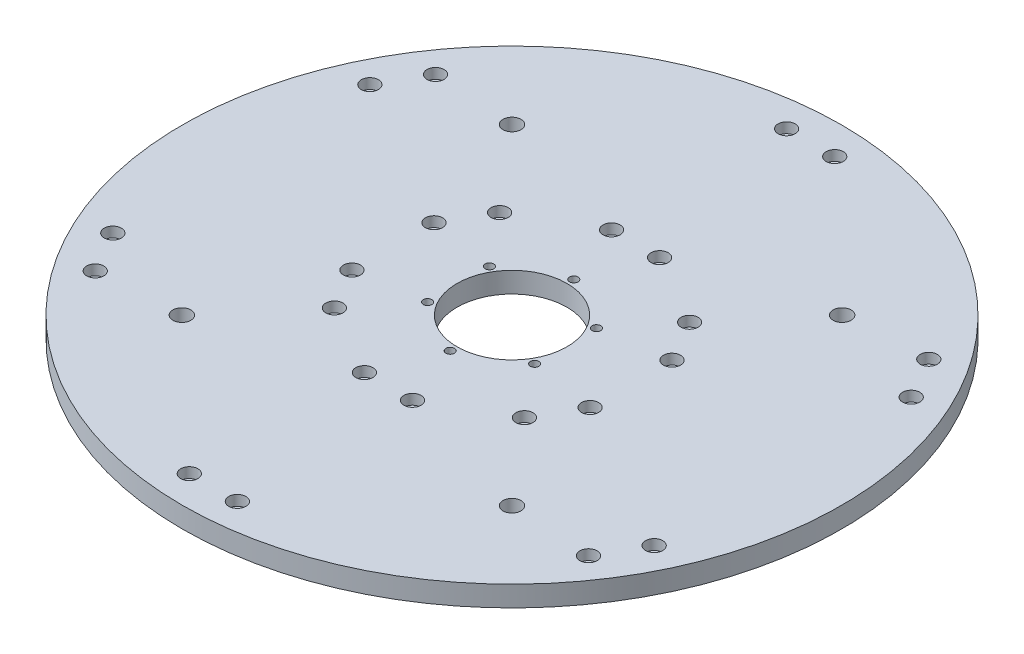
ISO-10303-21;
HEADER;
FILE_DESCRIPTION(('STEP AP214'),'2;1');
FILE_NAME('part.step','',(''),(''),'','','');
FILE_SCHEMA(('AUTOMOTIVE_DESIGN { 1 0 10303 214 1 1 1 1 }'));
ENDSEC;
DATA;
#1=APPLICATION_CONTEXT('core data for automotive mechanical design processes');
#2=APPLICATION_PROTOCOL_DEFINITION('international standard','automotive_design',2000,#1);
#3=PRODUCT_CONTEXT('',#1,'mechanical');
#4=PRODUCT('Part','Part','',(#3));
#5=PRODUCT_RELATED_PRODUCT_CATEGORY('part','',(#4));
#6=PRODUCT_DEFINITION_FORMATION('','',#4);
#7=PRODUCT_DEFINITION_CONTEXT('part definition',#1,'design');
#8=PRODUCT_DEFINITION('design','',#6,#7);
#9=PRODUCT_DEFINITION_SHAPE('','',#8);
#10=(LENGTH_UNIT() NAMED_UNIT(*) SI_UNIT(.MILLI.,.METRE.));
#11=(NAMED_UNIT(*) PLANE_ANGLE_UNIT() SI_UNIT($,.RADIAN.));
#12=(NAMED_UNIT(*) SI_UNIT($,.STERADIAN.) SOLID_ANGLE_UNIT());
#13=UNCERTAINTY_MEASURE_WITH_UNIT(LENGTH_MEASURE(1.E-05),#10,'distance_accuracy_value','');
#14=(GEOMETRIC_REPRESENTATION_CONTEXT(3) GLOBAL_UNCERTAINTY_ASSIGNED_CONTEXT((#13)) GLOBAL_UNIT_ASSIGNED_CONTEXT((#10,
#11,#12)) REPRESENTATION_CONTEXT('',''));
#15=CARTESIAN_POINT('',(0.,0.,0.));
#16=DIRECTION('',(0.,0.,1.));
#17=DIRECTION('',(1.,0.,0.));
#18=AXIS2_PLACEMENT_3D('',#15,#16,#17);
#19=CARTESIAN_POINT('',(0.,19.05,0.));
#20=DIRECTION('',(0.,1.,0.));
#21=DIRECTION('',(0.,0.,1.));
#22=AXIS2_PLACEMENT_3D('',#19,#20,#21);
#23=PLANE('',#22);
#24=CARTESIAN_POINT('',(0.,19.05,-57.15));
#25=DIRECTION('',(0.,1.,0.));
#26=DIRECTION('',(0.,0.,1.));
#27=AXIS2_PLACEMENT_3D('',#24,#25,#26);
#28=CIRCLE('',#27,3.96874999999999);
#29=CARTESIAN_POINT('',(0.,19.05,-53.18125));
#30=VERTEX_POINT('',#29);
#31=EDGE_CURVE('E391',#30,#30,#28,.T.);
#32=ORIENTED_EDGE('',*,*,#31,.F.);
#33=EDGE_LOOP('',(#32));
#34=FACE_BOUND('',#33,.T.);
#35=CARTESIAN_POINT('',(49.4933518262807,19.05,-28.5749999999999));
#36=DIRECTION('',(0.,1.,0.));
#37=DIRECTION('',(0.,0.,1.));
#38=AXIS2_PLACEMENT_3D('',#35,#36,#37);
#39=CIRCLE('',#38,3.96874999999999);
#40=CARTESIAN_POINT('',(49.4933518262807,19.05,-24.6062499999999));
#41=VERTEX_POINT('',#40);
#42=EDGE_CURVE('E385',#41,#41,#39,.T.);
#43=ORIENTED_EDGE('',*,*,#42,.F.);
#44=EDGE_LOOP('',(#43));
#45=FACE_BOUND('',#44,.T.);
#46=CARTESIAN_POINT('',(49.4933518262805,19.05,28.5750000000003));
#47=DIRECTION('',(0.,1.,0.));
#48=DIRECTION('',(0.,0.,1.));
#49=AXIS2_PLACEMENT_3D('',#46,#47,#48);
#50=CIRCLE('',#49,3.96874999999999);
#51=CARTESIAN_POINT('',(49.4933518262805,19.05,32.5437500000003));
#52=VERTEX_POINT('',#51);
#53=EDGE_CURVE('E379',#52,#52,#50,.T.);
#54=ORIENTED_EDGE('',*,*,#53,.F.);
#55=EDGE_LOOP('',(#54));
#56=FACE_BOUND('',#55,.T.);
#57=CARTESIAN_POINT('',(-4.64905891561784E-13,19.05,57.15));
#58=DIRECTION('',(0.,1.,0.));
#59=DIRECTION('',(0.,0.,1.));
#60=AXIS2_PLACEMENT_3D('',#57,#58,#59);
#61=CIRCLE('',#60,3.96874999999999);
#62=CARTESIAN_POINT('',(-4.64905891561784E-13,19.05,61.11875));
#63=VERTEX_POINT('',#62);
#64=EDGE_CURVE('E373',#63,#63,#61,.T.);
#65=ORIENTED_EDGE('',*,*,#64,.F.);
#66=EDGE_LOOP('',(#65));
#67=FACE_BOUND('',#66,.T.);
#68=CARTESIAN_POINT('',(-49.493351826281,19.05,28.5749999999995));
#69=DIRECTION('',(0.,1.,0.));
#70=DIRECTION('',(0.,0.,1.));
#71=AXIS2_PLACEMENT_3D('',#68,#69,#70);
#72=CIRCLE('',#71,3.96874999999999);
#73=CARTESIAN_POINT('',(-49.493351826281,19.05,32.5437499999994));
#74=VERTEX_POINT('',#73);
#75=EDGE_CURVE('E367',#74,#74,#72,.T.);
#76=ORIENTED_EDGE('',*,*,#75,.F.);
#77=EDGE_LOOP('',(#76));
#78=FACE_BOUND('',#77,.T.);
#79=CARTESIAN_POINT('',(-49.4933518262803,19.05,-28.5750000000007));
#80=DIRECTION('',(0.,1.,0.));
#81=DIRECTION('',(0.,0.,1.));
#82=AXIS2_PLACEMENT_3D('',#79,#80,#81);
#83=CIRCLE('',#82,3.96874999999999);
#84=CARTESIAN_POINT('',(-49.4933518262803,19.05,-24.6062500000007));
#85=VERTEX_POINT('',#84);
#86=EDGE_CURVE('E361',#85,#85,#83,.T.);
#87=ORIENTED_EDGE('',*,*,#86,.F.);
#88=EDGE_LOOP('',(#87));
#89=FACE_BOUND('',#88,.T.);
#90=CARTESIAN_POINT('',(-152.664354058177,19.05,152.664354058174));
#91=DIRECTION('',(0.,1.,0.));
#92=DIRECTION('',(1.,0.,0.));
#93=AXIS2_PLACEMENT_3D('',#90,#91,#92);
#94=CIRCLE('',#93,8.33373999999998);
#95=CARTESIAN_POINT('',(-144.330614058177,19.05,152.664354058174));
#96=VERTEX_POINT('',#95);
#97=EDGE_CURVE('E352',#96,#96,#94,.T.);
#98=ORIENTED_EDGE('',*,*,#97,.F.);
#99=EDGE_LOOP('',(#98));
#100=FACE_BOUND('',#99,.T.);
#101=CARTESIAN_POINT('',(152.664354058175,19.05,152.664354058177));
#102=DIRECTION('',(0.,1.,0.));
#103=DIRECTION('',(0.,0.,-1.));
#104=AXIS2_PLACEMENT_3D('',#101,#102,#103);
#105=CIRCLE('',#104,8.33373999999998);
#106=CARTESIAN_POINT('',(152.664354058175,19.05,144.330614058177));
#107=VERTEX_POINT('',#106);
#108=EDGE_CURVE('E346',#107,#107,#105,.T.);
#109=ORIENTED_EDGE('',*,*,#108,.F.);
#110=EDGE_LOOP('',(#109));
#111=FACE_BOUND('',#110,.T.);
#112=CARTESIAN_POINT('',(152.664354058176,19.05,-152.664354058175));
#113=DIRECTION('',(0.,1.,0.));
#114=DIRECTION('',(-1.,0.,0.));
#115=AXIS2_PLACEMENT_3D('',#112,#113,#114);
#116=CIRCLE('',#115,8.33373999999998);
#117=CARTESIAN_POINT('',(144.330614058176,19.05,-152.664354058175));
#118=VERTEX_POINT('',#117);
#119=EDGE_CURVE('E340',#118,#118,#116,.T.);
#120=ORIENTED_EDGE('',*,*,#119,.F.);
#121=EDGE_LOOP('',(#120));
#122=FACE_BOUND('',#121,.T.);
#123=CARTESIAN_POINT('',(-152.664354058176,19.05,-152.664354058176));
#124=DIRECTION('',(0.,1.,0.));
#125=DIRECTION('',(0.,0.,1.));
#126=AXIS2_PLACEMENT_3D('',#123,#124,#125);
#127=CIRCLE('',#126,8.33373999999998);
#128=CARTESIAN_POINT('',(-152.664354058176,19.05,-144.330614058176));
#129=VERTEX_POINT('',#128);
#130=EDGE_CURVE('E337',#129,#129,#127,.T.);
#131=ORIENTED_EDGE('',*,*,#130,.F.);
#132=EDGE_LOOP('',(#131));
#133=FACE_BOUND('',#132,.T.);
#134=CARTESIAN_POINT('',(228.105367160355,19.05,157.359914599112));
#135=DIRECTION('',(0.,1.,0.));
#136=DIRECTION('',(0.866025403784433,0.,0.50000000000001));
#137=AXIS2_PLACEMENT_3D('',#134,#135,#136);
#138=CIRCLE('',#137,7.9375);
#139=CARTESIAN_POINT('',(234.979443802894,19.05,161.328664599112));
#140=VERTEX_POINT('',#139);
#141=EDGE_CURVE('E331',#140,#140,#138,.T.);
#142=ORIENTED_EDGE('',*,*,#141,.F.);
#143=EDGE_LOOP('',(#142));
#144=FACE_BOUND('',#143,.T.);
#145=CARTESIAN_POINT('',(250.330367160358,19.05,-118.865085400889));
#146=DIRECTION('',(0.,1.,0.));
#147=DIRECTION('',(0.866025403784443,0.,-0.499999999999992));
#148=AXIS2_PLACEMENT_3D('',#145,#146,#147);
#149=CIRCLE('',#148,7.9375);
#150=CARTESIAN_POINT('',(257.204443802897,19.05,-122.833835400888));
#151=VERTEX_POINT('',#150);
#152=EDGE_CURVE('E319',#151,#151,#149,.T.);
#153=ORIENTED_EDGE('',*,*,#152,.F.);
#154=EDGE_LOOP('',(#153));
#155=FACE_BOUND('',#154,.T.);
#156=CARTESIAN_POINT('',(22.2250000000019,19.05,-276.225));
#157=DIRECTION('',(0.,1.,0.));
#158=DIRECTION('',(0.,0.,-1.));
#159=AXIS2_PLACEMENT_3D('',#156,#157,#158);
#160=CIRCLE('',#159,7.9375);
#161=CARTESIAN_POINT('',(22.225000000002,19.05,-284.1625));
#162=VERTEX_POINT('',#161);
#163=EDGE_CURVE('E307',#162,#162,#160,.T.);
#164=ORIENTED_EDGE('',*,*,#163,.F.);
#165=EDGE_LOOP('',(#164));
#166=FACE_BOUND('',#165,.T.);
#167=CARTESIAN_POINT('',(-228.105367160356,19.05,-157.35991459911));
#168=DIRECTION('',(0.,1.,0.));
#169=DIRECTION('',(-0.866025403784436,0.,-0.500000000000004));
#170=AXIS2_PLACEMENT_3D('',#167,#168,#169);
#171=CIRCLE('',#170,7.9375);
#172=CARTESIAN_POINT('',(-234.979443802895,19.05,-161.32866459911));
#173=VERTEX_POINT('',#172);
#174=EDGE_CURVE('E295',#173,#173,#171,.T.);
#175=ORIENTED_EDGE('',*,*,#174,.F.);
#176=EDGE_LOOP('',(#175));
#177=FACE_BOUND('',#176,.T.);
#178=CARTESIAN_POINT('',(-250.330367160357,19.05,118.86508540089));
#179=DIRECTION('',(0.,1.,0.));
#180=DIRECTION('',(-0.86602540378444,0.,0.499999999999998));
#181=AXIS2_PLACEMENT_3D('',#178,#179,#180);
#182=CIRCLE('',#181,7.9375);
#183=CARTESIAN_POINT('',(-257.204443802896,19.05,122.83383540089));
#184=VERTEX_POINT('',#183);
#185=EDGE_CURVE('E283',#184,#184,#182,.T.);
#186=ORIENTED_EDGE('',*,*,#185,.F.);
#187=EDGE_LOOP('',(#186));
#188=FACE_BOUND('',#187,.T.);
#189=CARTESIAN_POINT('',(250.330367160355,19.05,118.865085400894));
#190=DIRECTION('',(0.,1.,0.));
#191=DIRECTION('',(0.866025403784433,0.,0.50000000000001));
#192=AXIS2_PLACEMENT_3D('',#189,#190,#191);
#193=CIRCLE('',#192,7.9375);
#194=CARTESIAN_POINT('',(257.204443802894,19.05,122.833835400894));
#195=VERTEX_POINT('',#194);
#196=EDGE_CURVE('E271',#195,#195,#193,.T.);
#197=ORIENTED_EDGE('',*,*,#196,.F.);
#198=EDGE_LOOP('',(#197));
#199=FACE_BOUND('',#198,.T.);
#200=CARTESIAN_POINT('',(228.105367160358,19.05,-157.359914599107));
#201=DIRECTION('',(0.,1.,0.));
#202=DIRECTION('',(0.866025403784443,0.,-0.499999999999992));
#203=AXIS2_PLACEMENT_3D('',#200,#201,#202);
#204=CIRCLE('',#203,7.9375);
#205=CARTESIAN_POINT('',(234.979443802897,19.05,-161.328664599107));
#206=VERTEX_POINT('',#205);
#207=EDGE_CURVE('E259',#206,#206,#204,.T.);
#208=ORIENTED_EDGE('',*,*,#207,.F.);
#209=EDGE_LOOP('',(#208));
#210=FACE_BOUND('',#209,.T.);
#211=CARTESIAN_POINT('',(-22.2249999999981,19.05,-276.225));
#212=DIRECTION('',(0.,1.,0.));
#213=DIRECTION('',(0.,0.,-1.));
#214=AXIS2_PLACEMENT_3D('',#211,#212,#213);
#215=CIRCLE('',#214,7.9375);
#216=CARTESIAN_POINT('',(-22.224999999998,19.05,-284.1625));
#217=VERTEX_POINT('',#216);
#218=EDGE_CURVE('E247',#217,#217,#215,.T.);
#219=ORIENTED_EDGE('',*,*,#218,.F.);
#220=EDGE_LOOP('',(#219));
#221=FACE_BOUND('',#220,.T.);
#222=CARTESIAN_POINT('',(-250.330367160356,19.05,-118.865085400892));
#223=DIRECTION('',(0.,1.,0.));
#224=DIRECTION('',(-0.866025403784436,0.,-0.500000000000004));
#225=AXIS2_PLACEMENT_3D('',#222,#223,#224);
#226=CIRCLE('',#225,7.9375);
#227=CARTESIAN_POINT('',(-257.204443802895,19.05,-122.833835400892));
#228=VERTEX_POINT('',#227);
#229=EDGE_CURVE('E235',#228,#228,#226,.T.);
#230=ORIENTED_EDGE('',*,*,#229,.F.);
#231=EDGE_LOOP('',(#230));
#232=FACE_BOUND('',#231,.T.);
#233=CARTESIAN_POINT('',(-228.105367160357,19.05,157.359914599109));
#234=DIRECTION('',(0.,1.,0.));
#235=DIRECTION('',(-0.86602540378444,0.,0.499999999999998));
#236=AXIS2_PLACEMENT_3D('',#233,#234,#235);
#237=CIRCLE('',#236,7.9375);
#238=CARTESIAN_POINT('',(-234.979443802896,19.05,161.328664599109));
#239=VERTEX_POINT('',#238);
#240=EDGE_CURVE('E223',#239,#239,#237,.T.);
#241=ORIENTED_EDGE('',*,*,#240,.F.);
#242=EDGE_LOOP('',(#241));
#243=FACE_BOUND('',#242,.T.);
#244=CARTESIAN_POINT('',(87.8742036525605,19.05,76.3974145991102));
#245=DIRECTION('',(0.,1.,0.));
#246=DIRECTION('',(0.866025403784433,0.,0.50000000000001));
#247=AXIS2_PLACEMENT_3D('',#244,#245,#246);
#248=CIRCLE('',#247,7.9375);
#249=CARTESIAN_POINT('',(94.7482802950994,19.05,80.3661645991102));
#250=VERTEX_POINT('',#249);
#251=EDGE_CURVE('E211',#250,#250,#248,.T.);
#252=ORIENTED_EDGE('',*,*,#251,.F.);
#253=EDGE_LOOP('',(#252));
#254=FACE_BOUND('',#253,.T.);
#255=CARTESIAN_POINT('',(110.099203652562,19.05,-37.9025854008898));
#256=DIRECTION('',(0.,1.,0.));
#257=DIRECTION('',(0.866025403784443,0.,-0.499999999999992));
#258=AXIS2_PLACEMENT_3D('',#255,#256,#257);
#259=CIRCLE('',#258,7.9375);
#260=CARTESIAN_POINT('',(116.973280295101,19.05,-41.8713354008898));
#261=VERTEX_POINT('',#260);
#262=EDGE_CURVE('E199',#261,#261,#259,.T.);
#263=ORIENTED_EDGE('',*,*,#262,.F.);
#264=EDGE_LOOP('',(#263));
#265=FACE_BOUND('',#264,.T.);
#266=CARTESIAN_POINT('',(22.2250000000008,19.05,-114.3));
#267=DIRECTION('',(0.,1.,0.));
#268=DIRECTION('',(0.,0.,-1.));
#269=AXIS2_PLACEMENT_3D('',#266,#267,#268);
#270=CIRCLE('',#269,7.9375);
#271=CARTESIAN_POINT('',(22.2250000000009,19.05,-122.2375));
#272=VERTEX_POINT('',#271);
#273=EDGE_CURVE('E187',#272,#272,#270,.T.);
#274=ORIENTED_EDGE('',*,*,#273,.F.);
#275=EDGE_LOOP('',(#274));
#276=FACE_BOUND('',#275,.T.);
#277=CARTESIAN_POINT('',(-87.874203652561,19.05,-76.3974145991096));
#278=DIRECTION('',(0.,1.,0.));
#279=DIRECTION('',(-0.866025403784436,0.,-0.500000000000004));
#280=AXIS2_PLACEMENT_3D('',#277,#278,#279);
#281=CIRCLE('',#280,7.9375);
#282=CARTESIAN_POINT('',(-94.7482802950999,19.05,-80.3661645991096));
#283=VERTEX_POINT('',#282);
#284=EDGE_CURVE('E175',#283,#283,#281,.T.);
#285=ORIENTED_EDGE('',*,*,#284,.F.);
#286=EDGE_LOOP('',(#285));
#287=FACE_BOUND('',#286,.T.);
#288=CARTESIAN_POINT('',(-110.099203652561,19.05,37.9025854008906));
#289=DIRECTION('',(0.,1.,0.));
#290=DIRECTION('',(-0.86602540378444,0.,0.499999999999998));
#291=AXIS2_PLACEMENT_3D('',#288,#289,#290);
#292=CIRCLE('',#291,7.9375);
#293=CARTESIAN_POINT('',(-116.9732802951,19.05,41.8713354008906));
#294=VERTEX_POINT('',#293);
#295=EDGE_CURVE('E163',#294,#294,#292,.T.);
#296=ORIENTED_EDGE('',*,*,#295,.F.);
#297=EDGE_LOOP('',(#296));
#298=FACE_BOUND('',#297,.T.);
#299=CARTESIAN_POINT('',(110.099203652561,19.05,37.9025854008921));
#300=DIRECTION('',(0.,1.,0.));
#301=DIRECTION('',(0.866025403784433,0.,0.50000000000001));
#302=AXIS2_PLACEMENT_3D('',#299,#300,#301);
#303=CIRCLE('',#302,7.9375);
#304=CARTESIAN_POINT('',(116.9732802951,19.05,41.8713354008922));
#305=VERTEX_POINT('',#304);
#306=EDGE_CURVE('E151',#305,#305,#303,.T.);
#307=ORIENTED_EDGE('',*,*,#306,.F.);
#308=EDGE_LOOP('',(#307));
#309=FACE_BOUND('',#308,.T.);
#310=CARTESIAN_POINT('',(87.874203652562,19.05,-76.3974145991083));
#311=DIRECTION('',(0.,1.,0.));
#312=DIRECTION('',(0.866025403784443,0.,-0.499999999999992));
#313=AXIS2_PLACEMENT_3D('',#310,#311,#312);
#314=CIRCLE('',#313,7.9375);
#315=CARTESIAN_POINT('',(94.7482802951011,19.05,-80.3661645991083));
#316=VERTEX_POINT('',#315);
#317=EDGE_CURVE('E139',#316,#316,#314,.T.);
#318=ORIENTED_EDGE('',*,*,#317,.F.);
#319=EDGE_LOOP('',(#318));
#320=FACE_BOUND('',#319,.T.);
#321=CARTESIAN_POINT('',(-22.2249999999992,19.05,-114.3));
#322=DIRECTION('',(0.,1.,0.));
#323=DIRECTION('',(0.,0.,-1.));
#324=AXIS2_PLACEMENT_3D('',#321,#322,#323);
#325=CIRCLE('',#324,7.9375);
#326=CARTESIAN_POINT('',(-22.2249999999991,19.05,-122.2375));
#327=VERTEX_POINT('',#326);
#328=EDGE_CURVE('E127',#327,#327,#325,.T.);
#329=ORIENTED_EDGE('',*,*,#328,.F.);
#330=EDGE_LOOP('',(#329));
#331=FACE_BOUND('',#330,.T.);
#332=CARTESIAN_POINT('',(-110.099203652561,19.05,-37.9025854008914));
#333=DIRECTION('',(0.,1.,0.));
#334=DIRECTION('',(-0.866025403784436,0.,-0.500000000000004));
#335=AXIS2_PLACEMENT_3D('',#332,#333,#334);
#336=CIRCLE('',#335,7.9375);
#337=CARTESIAN_POINT('',(-116.9732802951,19.05,-41.8713354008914));
#338=VERTEX_POINT('',#337);
#339=EDGE_CURVE('E115',#338,#338,#336,.T.);
#340=ORIENTED_EDGE('',*,*,#339,.F.);
#341=EDGE_LOOP('',(#340));
#342=FACE_BOUND('',#341,.T.);
#343=CARTESIAN_POINT('',(-87.8742036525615,19.05,76.3974145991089));
#344=DIRECTION('',(0.,1.,0.));
#345=DIRECTION('',(-0.86602540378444,0.,0.499999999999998));
#346=AXIS2_PLACEMENT_3D('',#343,#344,#345);
#347=CIRCLE('',#346,7.9375);
#348=CARTESIAN_POINT('',(-94.7482802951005,19.05,80.3661645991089));
#349=VERTEX_POINT('',#348);
#350=EDGE_CURVE('E103',#349,#349,#347,.T.);
#351=ORIENTED_EDGE('',*,*,#350,.F.);
#352=EDGE_LOOP('',(#351));
#353=FACE_BOUND('',#352,.T.);
#354=CARTESIAN_POINT('',(22.225,19.05,114.3));
#355=DIRECTION('',(0.,1.,0.));
#356=DIRECTION('',(0.,0.,1.));
#357=AXIS2_PLACEMENT_3D('',#354,#355,#356);
#358=CIRCLE('',#357,7.9375);
#359=CARTESIAN_POINT('',(22.225,19.05,122.2375));
#360=VERTEX_POINT('',#359);
#361=EDGE_CURVE('E91',#360,#360,#358,.T.);
#362=ORIENTED_EDGE('',*,*,#361,.F.);
#363=EDGE_LOOP('',(#362));
#364=FACE_BOUND('',#363,.T.);
#365=CARTESIAN_POINT('',(-22.225,19.05,276.225));
#366=DIRECTION('',(0.,1.,0.));
#367=DIRECTION('',(0.,0.,1.));
#368=AXIS2_PLACEMENT_3D('',#365,#366,#367);
#369=CIRCLE('',#368,7.9375);
#370=CARTESIAN_POINT('',(-22.225,19.05,284.1625));
#371=VERTEX_POINT('',#370);
#372=EDGE_CURVE('E79',#371,#371,#369,.T.);
#373=ORIENTED_EDGE('',*,*,#372,.F.);
#374=EDGE_LOOP('',(#373));
#375=FACE_BOUND('',#374,.T.);
#376=CARTESIAN_POINT('',(22.225,19.05,276.225));
#377=DIRECTION('',(0.,1.,0.));
#378=DIRECTION('',(0.,0.,1.));
#379=AXIS2_PLACEMENT_3D('',#376,#377,#378);
#380=CIRCLE('',#379,7.9375);
#381=CARTESIAN_POINT('',(22.225,19.05,284.1625));
#382=VERTEX_POINT('',#381);
#383=EDGE_CURVE('E67',#382,#382,#380,.T.);
#384=ORIENTED_EDGE('',*,*,#383,.F.);
#385=EDGE_LOOP('',(#384));
#386=FACE_BOUND('',#385,.T.);
#387=CARTESIAN_POINT('',(-22.225,19.05,114.3));
#388=DIRECTION('',(0.,1.,0.));
#389=DIRECTION('',(0.,0.,1.));
#390=AXIS2_PLACEMENT_3D('',#387,#388,#389);
#391=CIRCLE('',#390,7.9375);
#392=CARTESIAN_POINT('',(-22.225,19.05,122.2375));
#393=VERTEX_POINT('',#392);
#394=EDGE_CURVE('E55',#393,#393,#391,.T.);
#395=ORIENTED_EDGE('',*,*,#394,.F.);
#396=EDGE_LOOP('',(#395));
#397=FACE_BOUND('',#396,.T.);
#398=CARTESIAN_POINT('',(0.,19.05,0.));
#399=DIRECTION('',(0.,1.,0.));
#400=DIRECTION('',(0.,0.,1.));
#401=AXIS2_PLACEMENT_3D('',#398,#399,#400);
#402=CIRCLE('',#401,304.8);
#403=CARTESIAN_POINT('',(0.,19.05,-304.8));
#404=VERTEX_POINT('',#403);
#405=EDGE_CURVE('E10',#404,#404,#402,.T.);
#406=ORIENTED_EDGE('',*,*,#405,.T.);
#407=EDGE_LOOP('',(#406));
#408=FACE_BOUND('',#407,.T.);
#409=CARTESIAN_POINT('',(0.,19.05,0.));
#410=DIRECTION('',(0.,1.,0.));
#411=DIRECTION('',(0.,0.,1.));
#412=AXIS2_PLACEMENT_3D('',#409,#410,#411);
#413=CIRCLE('',#412,50.8);
#414=CARTESIAN_POINT('',(0.,19.05,-50.8));
#415=VERTEX_POINT('',#414);
#416=EDGE_CURVE('E39',#415,#415,#413,.T.);
#417=ORIENTED_EDGE('',*,*,#416,.F.);
#418=EDGE_LOOP('',(#417));
#419=FACE_BOUND('',#418,.T.);
#420=ADVANCED_FACE('F28',(#34,#45,#56,#67,#78,#89,#100,#111,#122,#133,#144,#155,#166,#177,#188,
#199,#210,#221,#232,#243,#254,#265,#276,#287,#298,#309,#320,#331,#342,#353,#364,#375,#386,#397,
#408,#419),#23,.T.);
#421=CARTESIAN_POINT('',(0.,0.,0.));
#422=DIRECTION('',(0.,1.,0.));
#423=DIRECTION('',(0.,0.,1.));
#424=AXIS2_PLACEMENT_3D('',#421,#422,#423);
#425=PLANE('',#424);
#426=CARTESIAN_POINT('',(0.,0.,-57.15));
#427=DIRECTION('',(0.,1.,0.));
#428=DIRECTION('',(0.,0.,1.));
#429=AXIS2_PLACEMENT_3D('',#426,#427,#428);
#430=CIRCLE('',#429,3.96875);
#431=CARTESIAN_POINT('',(0.,0.,-53.18125));
#432=VERTEX_POINT('',#431);
#433=EDGE_CURVE('E388',#432,#432,#430,.T.);
#434=ORIENTED_EDGE('',*,*,#433,.T.);
#435=EDGE_LOOP('',(#434));
#436=FACE_BOUND('',#435,.T.);
#437=CARTESIAN_POINT('',(49.4933518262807,0.,-28.5749999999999));
#438=DIRECTION('',(0.,1.,0.));
#439=DIRECTION('',(0.,0.,1.));
#440=AXIS2_PLACEMENT_3D('',#437,#438,#439);
#441=CIRCLE('',#440,3.96874999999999);
#442=CARTESIAN_POINT('',(49.4933518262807,0.,-24.6062499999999));
#443=VERTEX_POINT('',#442);
#444=EDGE_CURVE('E382',#443,#443,#441,.T.);
#445=ORIENTED_EDGE('',*,*,#444,.T.);
#446=EDGE_LOOP('',(#445));
#447=FACE_BOUND('',#446,.T.);
#448=CARTESIAN_POINT('',(49.4933518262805,0.,28.5750000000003));
#449=DIRECTION('',(0.,1.,0.));
#450=DIRECTION('',(0.,0.,1.));
#451=AXIS2_PLACEMENT_3D('',#448,#449,#450);
#452=CIRCLE('',#451,3.96874999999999);
#453=CARTESIAN_POINT('',(49.4933518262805,0.,32.5437500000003));
#454=VERTEX_POINT('',#453);
#455=EDGE_CURVE('E376',#454,#454,#452,.T.);
#456=ORIENTED_EDGE('',*,*,#455,.T.);
#457=EDGE_LOOP('',(#456));
#458=FACE_BOUND('',#457,.T.);
#459=CARTESIAN_POINT('',(-4.64905891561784E-13,0.,57.15));
#460=DIRECTION('',(0.,1.,0.));
#461=DIRECTION('',(0.,0.,1.));
#462=AXIS2_PLACEMENT_3D('',#459,#460,#461);
#463=CIRCLE('',#462,3.96875);
#464=CARTESIAN_POINT('',(-4.64905891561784E-13,0.,61.11875));
#465=VERTEX_POINT('',#464);
#466=EDGE_CURVE('E370',#465,#465,#463,.T.);
#467=ORIENTED_EDGE('',*,*,#466,.T.);
#468=EDGE_LOOP('',(#467));
#469=FACE_BOUND('',#468,.T.);
#470=CARTESIAN_POINT('',(-49.493351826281,0.,28.5749999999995));
#471=DIRECTION('',(0.,1.,0.));
#472=DIRECTION('',(0.,0.,1.));
#473=AXIS2_PLACEMENT_3D('',#470,#471,#472);
#474=CIRCLE('',#473,3.96874999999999);
#475=CARTESIAN_POINT('',(-49.493351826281,0.,32.5437499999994));
#476=VERTEX_POINT('',#475);
#477=EDGE_CURVE('E364',#476,#476,#474,.T.);
#478=ORIENTED_EDGE('',*,*,#477,.T.);
#479=EDGE_LOOP('',(#478));
#480=FACE_BOUND('',#479,.T.);
#481=CARTESIAN_POINT('',(-49.4933518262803,0.,-28.5750000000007));
#482=DIRECTION('',(0.,1.,0.));
#483=DIRECTION('',(0.,0.,1.));
#484=AXIS2_PLACEMENT_3D('',#481,#482,#483);
#485=CIRCLE('',#484,3.96874999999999);
#486=CARTESIAN_POINT('',(-49.4933518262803,0.,-24.6062500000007));
#487=VERTEX_POINT('',#486);
#488=EDGE_CURVE('E358',#487,#487,#485,.T.);
#489=ORIENTED_EDGE('',*,*,#488,.T.);
#490=EDGE_LOOP('',(#489));
#491=FACE_BOUND('',#490,.T.);
#492=CARTESIAN_POINT('',(-152.664354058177,0.,152.664354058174));
#493=DIRECTION('',(0.,1.,0.));
#494=DIRECTION('',(1.,0.,0.));
#495=AXIS2_PLACEMENT_3D('',#492,#493,#494);
#496=CIRCLE('',#495,8.33374000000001);
#497=CARTESIAN_POINT('',(-144.330614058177,0.,152.664354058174));
#498=VERTEX_POINT('',#497);
#499=EDGE_CURVE('E355',#498,#498,#496,.T.);
#500=ORIENTED_EDGE('',*,*,#499,.T.);
#501=EDGE_LOOP('',(#500));
#502=FACE_BOUND('',#501,.T.);
#503=CARTESIAN_POINT('',(152.664354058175,0.,152.664354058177));
#504=DIRECTION('',(0.,1.,0.));
#505=DIRECTION('',(0.,0.,-1.));
#506=AXIS2_PLACEMENT_3D('',#503,#504,#505);
#507=CIRCLE('',#506,8.33374000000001);
#508=CARTESIAN_POINT('',(152.664354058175,0.,144.330614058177));
#509=VERTEX_POINT('',#508);
#510=EDGE_CURVE('E349',#509,#509,#507,.T.);
#511=ORIENTED_EDGE('',*,*,#510,.T.);
#512=EDGE_LOOP('',(#511));
#513=FACE_BOUND('',#512,.T.);
#514=CARTESIAN_POINT('',(152.664354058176,0.,-152.664354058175));
#515=DIRECTION('',(0.,1.,0.));
#516=DIRECTION('',(-1.,0.,0.));
#517=AXIS2_PLACEMENT_3D('',#514,#515,#516);
#518=CIRCLE('',#517,8.33374000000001);
#519=CARTESIAN_POINT('',(144.330614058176,0.,-152.664354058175));
#520=VERTEX_POINT('',#519);
#521=EDGE_CURVE('E343',#520,#520,#518,.T.);
#522=ORIENTED_EDGE('',*,*,#521,.T.);
#523=EDGE_LOOP('',(#522));
#524=FACE_BOUND('',#523,.T.);
#525=CARTESIAN_POINT('',(-152.664354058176,0.,-152.664354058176));
#526=DIRECTION('',(0.,1.,0.));
#527=DIRECTION('',(0.,0.,1.));
#528=AXIS2_PLACEMENT_3D('',#525,#526,#527);
#529=CIRCLE('',#528,8.33374000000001);
#530=CARTESIAN_POINT('',(-152.664354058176,0.,-144.330614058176));
#531=VERTEX_POINT('',#530);
#532=EDGE_CURVE('E334',#531,#531,#529,.T.);
#533=ORIENTED_EDGE('',*,*,#532,.T.);
#534=EDGE_LOOP('',(#533));
#535=FACE_BOUND('',#534,.T.);
#536=CARTESIAN_POINT('',(228.105367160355,0.,157.359914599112));
#537=DIRECTION('',(0.,1.,0.));
#538=DIRECTION('',(0.866025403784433,0.,0.50000000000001));
#539=AXIS2_PLACEMENT_3D('',#536,#537,#538);
#540=CIRCLE('',#539,5.04189999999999);
#541=CARTESIAN_POINT('',(232.471780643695,0.,159.880864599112));
#542=VERTEX_POINT('',#541);
#543=EDGE_CURVE('E328',#542,#542,#540,.T.);
#544=ORIENTED_EDGE('',*,*,#543,.T.);
#545=EDGE_LOOP('',(#544));
#546=FACE_BOUND('',#545,.T.);
#547=CARTESIAN_POINT('',(250.330367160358,0.,-118.865085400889));
#548=DIRECTION('',(0.,1.,0.));
#549=DIRECTION('',(0.866025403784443,0.,-0.499999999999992));
#550=AXIS2_PLACEMENT_3D('',#547,#548,#549);
#551=CIRCLE('',#550,5.04189999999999);
#552=CARTESIAN_POINT('',(254.696780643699,0.,-121.386035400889));
#553=VERTEX_POINT('',#552);
#554=EDGE_CURVE('E316',#553,#553,#551,.T.);
#555=ORIENTED_EDGE('',*,*,#554,.T.);
#556=EDGE_LOOP('',(#555));
#557=FACE_BOUND('',#556,.T.);
#558=CARTESIAN_POINT('',(22.2250000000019,0.,-276.225));
#559=DIRECTION('',(0.,1.,0.));
#560=DIRECTION('',(0.,0.,-1.));
#561=AXIS2_PLACEMENT_3D('',#558,#559,#560);
#562=CIRCLE('',#561,5.04189999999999);
#563=CARTESIAN_POINT('',(22.225000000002,0.,-281.2669));
#564=VERTEX_POINT('',#563);
#565=EDGE_CURVE('E304',#564,#564,#562,.T.);
#566=ORIENTED_EDGE('',*,*,#565,.T.);
#567=EDGE_LOOP('',(#566));
#568=FACE_BOUND('',#567,.T.);
#569=CARTESIAN_POINT('',(-228.105367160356,0.,-157.35991459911));
#570=DIRECTION('',(0.,1.,0.));
#571=DIRECTION('',(-0.866025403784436,0.,-0.500000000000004));
#572=AXIS2_PLACEMENT_3D('',#569,#570,#571);
#573=CIRCLE('',#572,5.04189999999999);
#574=CARTESIAN_POINT('',(-232.471780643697,0.,-159.88086459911));
#575=VERTEX_POINT('',#574);
#576=EDGE_CURVE('E292',#575,#575,#573,.T.);
#577=ORIENTED_EDGE('',*,*,#576,.T.);
#578=EDGE_LOOP('',(#577));
#579=FACE_BOUND('',#578,.T.);
#580=CARTESIAN_POINT('',(-250.330367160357,0.,118.86508540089));
#581=DIRECTION('',(0.,1.,0.));
#582=DIRECTION('',(-0.86602540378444,0.,0.499999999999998));
#583=AXIS2_PLACEMENT_3D('',#580,#581,#582);
#584=CIRCLE('',#583,5.04189999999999);
#585=CARTESIAN_POINT('',(-254.696780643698,0.,121.38603540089));
#586=VERTEX_POINT('',#585);
#587=EDGE_CURVE('E280',#586,#586,#584,.T.);
#588=ORIENTED_EDGE('',*,*,#587,.T.);
#589=EDGE_LOOP('',(#588));
#590=FACE_BOUND('',#589,.T.);
#591=CARTESIAN_POINT('',(250.330367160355,0.,118.865085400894));
#592=DIRECTION('',(0.,1.,0.));
#593=DIRECTION('',(0.866025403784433,0.,0.50000000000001));
#594=AXIS2_PLACEMENT_3D('',#591,#592,#593);
#595=CIRCLE('',#594,5.04189999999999);
#596=CARTESIAN_POINT('',(254.696780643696,0.,121.386035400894));
#597=VERTEX_POINT('',#596);
#598=EDGE_CURVE('E268',#597,#597,#595,.T.);
#599=ORIENTED_EDGE('',*,*,#598,.T.);
#600=EDGE_LOOP('',(#599));
#601=FACE_BOUND('',#600,.T.);
#602=CARTESIAN_POINT('',(228.105367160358,0.,-157.359914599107));
#603=DIRECTION('',(0.,1.,0.));
#604=DIRECTION('',(0.866025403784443,0.,-0.499999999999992));
#605=AXIS2_PLACEMENT_3D('',#602,#603,#604);
#606=CIRCLE('',#605,5.04189999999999);
#607=CARTESIAN_POINT('',(232.471780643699,0.,-159.880864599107));
#608=VERTEX_POINT('',#607);
#609=EDGE_CURVE('E256',#608,#608,#606,.T.);
#610=ORIENTED_EDGE('',*,*,#609,.T.);
#611=EDGE_LOOP('',(#610));
#612=FACE_BOUND('',#611,.T.);
#613=CARTESIAN_POINT('',(-22.2249999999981,0.,-276.225));
#614=DIRECTION('',(0.,1.,0.));
#615=DIRECTION('',(0.,0.,-1.));
#616=AXIS2_PLACEMENT_3D('',#613,#614,#615);
#617=CIRCLE('',#616,5.04189999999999);
#618=CARTESIAN_POINT('',(-22.224999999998,0.,-281.2669));
#619=VERTEX_POINT('',#618);
#620=EDGE_CURVE('E244',#619,#619,#617,.T.);
#621=ORIENTED_EDGE('',*,*,#620,.T.);
#622=EDGE_LOOP('',(#621));
#623=FACE_BOUND('',#622,.T.);
#624=CARTESIAN_POINT('',(-250.330367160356,0.,-118.865085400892));
#625=DIRECTION('',(0.,1.,0.));
#626=DIRECTION('',(-0.866025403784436,0.,-0.500000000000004));
#627=AXIS2_PLACEMENT_3D('',#624,#625,#626);
#628=CIRCLE('',#627,5.04189999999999);
#629=CARTESIAN_POINT('',(-254.696780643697,0.,-121.386035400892));
#630=VERTEX_POINT('',#629);
#631=EDGE_CURVE('E232',#630,#630,#628,.T.);
#632=ORIENTED_EDGE('',*,*,#631,.T.);
#633=EDGE_LOOP('',(#632));
#634=FACE_BOUND('',#633,.T.);
#635=CARTESIAN_POINT('',(-228.105367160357,0.,157.359914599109));
#636=DIRECTION('',(0.,1.,0.));
#637=DIRECTION('',(-0.86602540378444,0.,0.499999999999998));
#638=AXIS2_PLACEMENT_3D('',#635,#636,#637);
#639=CIRCLE('',#638,5.04189999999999);
#640=CARTESIAN_POINT('',(-232.471780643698,0.,159.880864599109));
#641=VERTEX_POINT('',#640);
#642=EDGE_CURVE('E220',#641,#641,#639,.T.);
#643=ORIENTED_EDGE('',*,*,#642,.T.);
#644=EDGE_LOOP('',(#643));
#645=FACE_BOUND('',#644,.T.);
#646=CARTESIAN_POINT('',(87.8742036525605,0.,76.3974145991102));
#647=DIRECTION('',(0.,1.,0.));
#648=DIRECTION('',(0.866025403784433,0.,0.50000000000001));
#649=AXIS2_PLACEMENT_3D('',#646,#647,#648);
#650=CIRCLE('',#649,5.04189999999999);
#651=CARTESIAN_POINT('',(92.2406171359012,0.,78.9183645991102));
#652=VERTEX_POINT('',#651);
#653=EDGE_CURVE('E208',#652,#652,#650,.T.);
#654=ORIENTED_EDGE('',*,*,#653,.T.);
#655=EDGE_LOOP('',(#654));
#656=FACE_BOUND('',#655,.T.);
#657=CARTESIAN_POINT('',(110.099203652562,0.,-37.9025854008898));
#658=DIRECTION('',(0.,1.,0.));
#659=DIRECTION('',(0.866025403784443,0.,-0.499999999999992));
#660=AXIS2_PLACEMENT_3D('',#657,#658,#659);
#661=CIRCLE('',#660,5.04189999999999);
#662=CARTESIAN_POINT('',(114.465617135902,0.,-40.4235354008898));
#663=VERTEX_POINT('',#662);
#664=EDGE_CURVE('E196',#663,#663,#661,.T.);
#665=ORIENTED_EDGE('',*,*,#664,.T.);
#666=EDGE_LOOP('',(#665));
#667=FACE_BOUND('',#666,.T.);
#668=CARTESIAN_POINT('',(22.2250000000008,0.,-114.3));
#669=DIRECTION('',(0.,1.,0.));
#670=DIRECTION('',(0.,0.,-1.));
#671=AXIS2_PLACEMENT_3D('',#668,#669,#670);
#672=CIRCLE('',#671,5.04189999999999);
#673=CARTESIAN_POINT('',(22.2250000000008,0.,-119.3419));
#674=VERTEX_POINT('',#673);
#675=EDGE_CURVE('E184',#674,#674,#672,.T.);
#676=ORIENTED_EDGE('',*,*,#675,.T.);
#677=EDGE_LOOP('',(#676));
#678=FACE_BOUND('',#677,.T.);
#679=CARTESIAN_POINT('',(-87.874203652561,0.,-76.3974145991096));
#680=DIRECTION('',(0.,1.,0.));
#681=DIRECTION('',(-0.866025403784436,0.,-0.500000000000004));
#682=AXIS2_PLACEMENT_3D('',#679,#680,#681);
#683=CIRCLE('',#682,5.04189999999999);
#684=CARTESIAN_POINT('',(-92.2406171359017,0.,-78.9183645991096));
#685=VERTEX_POINT('',#684);
#686=EDGE_CURVE('E172',#685,#685,#683,.T.);
#687=ORIENTED_EDGE('',*,*,#686,.T.);
#688=EDGE_LOOP('',(#687));
#689=FACE_BOUND('',#688,.T.);
#690=CARTESIAN_POINT('',(-110.099203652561,0.,37.9025854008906));
#691=DIRECTION('',(0.,1.,0.));
#692=DIRECTION('',(-0.86602540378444,0.,0.499999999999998));
#693=AXIS2_PLACEMENT_3D('',#690,#691,#692);
#694=CIRCLE('',#693,5.04189999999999);
#695=CARTESIAN_POINT('',(-114.465617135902,0.,40.4235354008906));
#696=VERTEX_POINT('',#695);
#697=EDGE_CURVE('E160',#696,#696,#694,.T.);
#698=ORIENTED_EDGE('',*,*,#697,.T.);
#699=EDGE_LOOP('',(#698));
#700=FACE_BOUND('',#699,.T.);
#701=CARTESIAN_POINT('',(110.099203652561,0.,37.9025854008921));
#702=DIRECTION('',(0.,1.,0.));
#703=DIRECTION('',(0.866025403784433,0.,0.50000000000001));
#704=AXIS2_PLACEMENT_3D('',#701,#702,#703);
#705=CIRCLE('',#704,5.04189999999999);
#706=CARTESIAN_POINT('',(114.465617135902,0.,40.4235354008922));
#707=VERTEX_POINT('',#706);
#708=EDGE_CURVE('E148',#707,#707,#705,.T.);
#709=ORIENTED_EDGE('',*,*,#708,.T.);
#710=EDGE_LOOP('',(#709));
#711=FACE_BOUND('',#710,.T.);
#712=CARTESIAN_POINT('',(87.874203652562,0.,-76.3974145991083));
#713=DIRECTION('',(0.,1.,0.));
#714=DIRECTION('',(0.866025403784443,0.,-0.499999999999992));
#715=AXIS2_PLACEMENT_3D('',#712,#713,#714);
#716=CIRCLE('',#715,5.04189999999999);
#717=CARTESIAN_POINT('',(92.2406171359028,0.,-78.9183645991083));
#718=VERTEX_POINT('',#717);
#719=EDGE_CURVE('E136',#718,#718,#716,.T.);
#720=ORIENTED_EDGE('',*,*,#719,.T.);
#721=EDGE_LOOP('',(#720));
#722=FACE_BOUND('',#721,.T.);
#723=CARTESIAN_POINT('',(-22.2249999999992,0.,-114.3));
#724=DIRECTION('',(0.,1.,0.));
#725=DIRECTION('',(0.,0.,-1.));
#726=AXIS2_PLACEMENT_3D('',#723,#724,#725);
#727=CIRCLE('',#726,5.04189999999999);
#728=CARTESIAN_POINT('',(-22.2249999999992,0.,-119.3419));
#729=VERTEX_POINT('',#728);
#730=EDGE_CURVE('E124',#729,#729,#727,.T.);
#731=ORIENTED_EDGE('',*,*,#730,.T.);
#732=EDGE_LOOP('',(#731));
#733=FACE_BOUND('',#732,.T.);
#734=CARTESIAN_POINT('',(-110.099203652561,0.,-37.9025854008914));
#735=DIRECTION('',(0.,1.,0.));
#736=DIRECTION('',(-0.866025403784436,0.,-0.500000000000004));
#737=AXIS2_PLACEMENT_3D('',#734,#735,#736);
#738=CIRCLE('',#737,5.04189999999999);
#739=CARTESIAN_POINT('',(-114.465617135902,0.,-40.4235354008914));
#740=VERTEX_POINT('',#739);
#741=EDGE_CURVE('E112',#740,#740,#738,.T.);
#742=ORIENTED_EDGE('',*,*,#741,.T.);
#743=EDGE_LOOP('',(#742));
#744=FACE_BOUND('',#743,.T.);
#745=CARTESIAN_POINT('',(-87.8742036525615,0.,76.3974145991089));
#746=DIRECTION('',(0.,1.,0.));
#747=DIRECTION('',(-0.86602540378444,0.,0.499999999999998));
#748=AXIS2_PLACEMENT_3D('',#745,#746,#747);
#749=CIRCLE('',#748,5.04189999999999);
#750=CARTESIAN_POINT('',(-92.2406171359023,0.,78.9183645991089));
#751=VERTEX_POINT('',#750);
#752=EDGE_CURVE('E100',#751,#751,#749,.T.);
#753=ORIENTED_EDGE('',*,*,#752,.T.);
#754=EDGE_LOOP('',(#753));
#755=FACE_BOUND('',#754,.T.);
#756=CARTESIAN_POINT('',(22.225,0.,114.3));
#757=DIRECTION('',(0.,1.,0.));
#758=DIRECTION('',(0.,0.,1.));
#759=AXIS2_PLACEMENT_3D('',#756,#757,#758);
#760=CIRCLE('',#759,5.04189999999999);
#761=CARTESIAN_POINT('',(22.225,0.,119.3419));
#762=VERTEX_POINT('',#761);
#763=EDGE_CURVE('E82',#762,#762,#760,.T.);
#764=ORIENTED_EDGE('',*,*,#763,.T.);
#765=EDGE_LOOP('',(#764));
#766=FACE_BOUND('',#765,.T.);
#767=CARTESIAN_POINT('',(-22.225,0.,276.225));
#768=DIRECTION('',(0.,1.,0.));
#769=DIRECTION('',(0.,0.,1.));
#770=AXIS2_PLACEMENT_3D('',#767,#768,#769);
#771=CIRCLE('',#770,5.04189999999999);
#772=CARTESIAN_POINT('',(-22.225,0.,281.2669));
#773=VERTEX_POINT('',#772);
#774=EDGE_CURVE('E70',#773,#773,#771,.T.);
#775=ORIENTED_EDGE('',*,*,#774,.T.);
#776=EDGE_LOOP('',(#775));
#777=FACE_BOUND('',#776,.T.);
#778=CARTESIAN_POINT('',(22.225,0.,276.225));
#779=DIRECTION('',(0.,1.,0.));
#780=DIRECTION('',(0.,0.,1.));
#781=AXIS2_PLACEMENT_3D('',#778,#779,#780);
#782=CIRCLE('',#781,5.04189999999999);
#783=CARTESIAN_POINT('',(22.225,0.,281.2669));
#784=VERTEX_POINT('',#783);
#785=EDGE_CURVE('E58',#784,#784,#782,.T.);
#786=ORIENTED_EDGE('',*,*,#785,.T.);
#787=EDGE_LOOP('',(#786));
#788=FACE_BOUND('',#787,.T.);
#789=CARTESIAN_POINT('',(-22.225,0.,114.3));
#790=DIRECTION('',(0.,1.,0.));
#791=DIRECTION('',(0.,0.,1.));
#792=AXIS2_PLACEMENT_3D('',#789,#790,#791);
#793=CIRCLE('',#792,5.04189999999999);
#794=CARTESIAN_POINT('',(-22.225,0.,119.3419));
#795=VERTEX_POINT('',#794);
#796=EDGE_CURVE('E44',#795,#795,#793,.T.);
#797=ORIENTED_EDGE('',*,*,#796,.T.);
#798=EDGE_LOOP('',(#797));
#799=FACE_BOUND('',#798,.T.);
#800=CARTESIAN_POINT('',(0.,0.,0.));
#801=DIRECTION('',(0.,1.,0.));
#802=DIRECTION('',(0.,0.,1.));
#803=AXIS2_PLACEMENT_3D('',#800,#801,#802);
#804=CIRCLE('',#803,304.8);
#805=CARTESIAN_POINT('',(0.,0.,-304.8));
#806=VERTEX_POINT('',#805);
#807=EDGE_CURVE('E32',#806,#806,#804,.T.);
#808=ORIENTED_EDGE('',*,*,#807,.F.);
#809=EDGE_LOOP('',(#808));
#810=FACE_BOUND('',#809,.T.);
#811=CARTESIAN_POINT('',(0.,0.,0.));
#812=DIRECTION('',(0.,1.,0.));
#813=DIRECTION('',(0.,0.,1.));
#814=AXIS2_PLACEMENT_3D('',#811,#812,#813);
#815=CIRCLE('',#814,50.8);
#816=CARTESIAN_POINT('',(0.,0.,-50.8));
#817=VERTEX_POINT('',#816);
#818=EDGE_CURVE('E41',#817,#817,#815,.T.);
#819=ORIENTED_EDGE('',*,*,#818,.T.);
#820=EDGE_LOOP('',(#819));
#821=FACE_BOUND('',#820,.T.);
#822=ADVANCED_FACE('F399',(#436,#447,#458,#469,#480,#491,#502,#513,#524,#535,#546,#557,#568,
#579,#590,#601,#612,#623,#634,#645,#656,#667,#678,#689,#700,#711,#722,#733,#744,#755,#766,#777,
#788,#799,#810,#821),#425,.F.);
#823=CARTESIAN_POINT('',(0.,19.05,0.));
#824=DIRECTION('',(0.,-1.,0.));
#825=DIRECTION('',(0.,0.,-1.));
#826=AXIS2_PLACEMENT_3D('',#823,#824,#825);
#827=CYLINDRICAL_SURFACE('',#826,304.8);
#828=CARTESIAN_POINT('',(0.,19.05,-304.8));
#829=CARTESIAN_POINT('',(0.,18.8515625,-304.8));
#830=CARTESIAN_POINT('',(0.,18.653125,-304.8));
#831=CARTESIAN_POINT('',(0.,18.25625,-304.8));
#832=CARTESIAN_POINT('',(0.,18.0578125,-304.8));
#833=CARTESIAN_POINT('',(0.,17.6609375,-304.8));
#834=CARTESIAN_POINT('',(0.,17.4625,-304.8));
#835=CARTESIAN_POINT('',(0.,17.065625,-304.8));
#836=CARTESIAN_POINT('',(0.,16.8671875,-304.8));
#837=CARTESIAN_POINT('',(0.,16.4703125,-304.8));
#838=CARTESIAN_POINT('',(0.,16.271875,-304.8));
#839=CARTESIAN_POINT('',(0.,15.875,-304.8));
#840=CARTESIAN_POINT('',(0.,15.6765625,-304.8));
#841=CARTESIAN_POINT('',(0.,15.2796875,-304.8));
#842=CARTESIAN_POINT('',(0.,15.08125,-304.8));
#843=CARTESIAN_POINT('',(0.,14.684375,-304.8));
#844=CARTESIAN_POINT('',(0.,14.4859375,-304.8));
#845=CARTESIAN_POINT('',(0.,14.0890625,-304.8));
#846=CARTESIAN_POINT('',(0.,13.890625,-304.8));
#847=CARTESIAN_POINT('',(0.,13.49375,-304.8));
#848=CARTESIAN_POINT('',(0.,13.2953125,-304.8));
#849=CARTESIAN_POINT('',(0.,12.8984375,-304.8));
#850=CARTESIAN_POINT('',(0.,12.7,-304.8));
#851=CARTESIAN_POINT('',(0.,12.303125,-304.8));
#852=CARTESIAN_POINT('',(0.,12.1046875,-304.8));
#853=CARTESIAN_POINT('',(0.,11.7078125,-304.8));
#854=CARTESIAN_POINT('',(0.,11.509375,-304.8));
#855=CARTESIAN_POINT('',(0.,11.1125,-304.8));
#856=CARTESIAN_POINT('',(0.,10.9140625,-304.8));
#857=CARTESIAN_POINT('',(0.,10.5171875,-304.8));
#858=CARTESIAN_POINT('',(0.,10.31875,-304.8));
#859=CARTESIAN_POINT('',(0.,9.921875,-304.8));
#860=CARTESIAN_POINT('',(0.,9.7234375,-304.8));
#861=CARTESIAN_POINT('',(0.,9.3265625,-304.8));
#862=CARTESIAN_POINT('',(0.,9.128125,-304.8));
#863=CARTESIAN_POINT('',(0.,8.73125,-304.8));
#864=CARTESIAN_POINT('',(0.,8.5328125,-304.8));
#865=CARTESIAN_POINT('',(0.,8.1359375,-304.8));
#866=CARTESIAN_POINT('',(0.,7.9375,-304.8));
#867=CARTESIAN_POINT('',(0.,7.540625,-304.8));
#868=CARTESIAN_POINT('',(0.,7.3421875,-304.8));
#869=CARTESIAN_POINT('',(0.,6.9453125,-304.8));
#870=CARTESIAN_POINT('',(0.,6.746875,-304.8));
#871=CARTESIAN_POINT('',(0.,6.35,-304.8));
#872=CARTESIAN_POINT('',(0.,6.1515625,-304.8));
#873=CARTESIAN_POINT('',(0.,5.7546875,-304.8));
#874=CARTESIAN_POINT('',(0.,5.55625,-304.8));
#875=CARTESIAN_POINT('',(0.,5.159375,-304.8));
#876=CARTESIAN_POINT('',(0.,4.9609375,-304.8));
#877=CARTESIAN_POINT('',(0.,4.5640625,-304.8));
#878=CARTESIAN_POINT('',(0.,4.365625,-304.8));
#879=CARTESIAN_POINT('',(0.,3.96875,-304.8));
#880=CARTESIAN_POINT('',(0.,3.7703125,-304.8));
#881=CARTESIAN_POINT('',(0.,3.3734375,-304.8));
#882=CARTESIAN_POINT('',(0.,3.175,-304.8));
#883=CARTESIAN_POINT('',(0.,2.778125,-304.8));
#884=CARTESIAN_POINT('',(0.,2.5796875,-304.8));
#885=CARTESIAN_POINT('',(0.,2.1828125,-304.8));
#886=CARTESIAN_POINT('',(0.,1.984375,-304.8));
#887=CARTESIAN_POINT('',(0.,1.5875,-304.8));
#888=CARTESIAN_POINT('',(0.,1.3890625,-304.8));
#889=CARTESIAN_POINT('',(0.,0.992187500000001,-304.8));
#890=CARTESIAN_POINT('',(0.,0.793750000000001,-304.8));
#891=CARTESIAN_POINT('',(0.,0.396875,-304.8));
#892=CARTESIAN_POINT('',(0.,0.1984375,-304.8));
#893=CARTESIAN_POINT('',(0.,0.,-304.8));
#894=B_SPLINE_CURVE_WITH_KNOTS('',3,(#828,#829,#830,#831,#832,#833,#834,#835,#836,#837,#838,
#839,#840,#841,#842,#843,#844,#845,#846,#847,#848,#849,#850,#851,#852,#853,#854,#855,#856,#857,
#858,#859,#860,#861,#862,#863,#864,#865,#866,#867,#868,#869,#870,#871,#872,#873,#874,#875,#876,
#877,#878,#879,#880,#881,#882,#883,#884,#885,#886,#887,#888,#889,#890,#891,#892,#893),
.UNSPECIFIED.,.F.,.F.,(4,2,2,2,2,2,2,2,2,2,2,2,2,2,2,2,2,2,2,2,2,2,2,2,2,2,2,2,2,2,2,2,4),(0.,
0.595312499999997,1.190625,1.7859375,2.38125,2.9765625,3.571875,4.1671875,4.7625,5.3578125,
5.953125,6.5484375,7.14375,7.7390625,8.334375,8.9296875,9.525,10.1203125,10.715625,11.3109375,
11.90625,12.5015625,13.096875,13.6921875,14.2875,14.8828125,15.478125,16.0734375,16.66875,
17.2640625,17.859375,18.4546875,19.05),.UNSPECIFIED.);
#895=EDGE_CURVE('BSEAM30',#404,#806,#894,.T.);
#896=ORIENTED_EDGE('',*,*,#405,.F.);
#897=ORIENTED_EDGE('',*,*,#807,.T.);
#898=ORIENTED_EDGE('',*,*,#895,.T.);
#899=ORIENTED_EDGE('',*,*,#895,.F.);
#900=EDGE_LOOP('',(#896,#898,#897,#899));
#901=FACE_BOUND('',#900,.T.);
#902=ADVANCED_FACE('F30',(#901),#827,.T.);
#903=CARTESIAN_POINT('',(0.,19.05,0.));
#904=DIRECTION('',(0.,-1.,0.));
#905=DIRECTION('',(0.,0.,-1.));
#906=AXIS2_PLACEMENT_3D('',#903,#904,#905);
#907=CYLINDRICAL_SURFACE('',#906,50.8);
#908=CARTESIAN_POINT('',(0.,19.05,-50.8));
#909=CARTESIAN_POINT('',(0.,18.8515625,-50.8));
#910=CARTESIAN_POINT('',(0.,18.653125,-50.8));
#911=CARTESIAN_POINT('',(0.,18.25625,-50.8));
#912=CARTESIAN_POINT('',(0.,18.0578125,-50.8));
#913=CARTESIAN_POINT('',(0.,17.6609375,-50.8));
#914=CARTESIAN_POINT('',(0.,17.4625,-50.8));
#915=CARTESIAN_POINT('',(0.,17.065625,-50.8));
#916=CARTESIAN_POINT('',(0.,16.8671875,-50.8));
#917=CARTESIAN_POINT('',(0.,16.4703125,-50.8));
#918=CARTESIAN_POINT('',(0.,16.271875,-50.8));
#919=CARTESIAN_POINT('',(0.,15.875,-50.8));
#920=CARTESIAN_POINT('',(0.,15.6765625,-50.8));
#921=CARTESIAN_POINT('',(0.,15.2796875,-50.8));
#922=CARTESIAN_POINT('',(0.,15.08125,-50.8));
#923=CARTESIAN_POINT('',(0.,14.684375,-50.8));
#924=CARTESIAN_POINT('',(0.,14.4859375,-50.8));
#925=CARTESIAN_POINT('',(0.,14.0890625,-50.8));
#926=CARTESIAN_POINT('',(0.,13.890625,-50.8));
#927=CARTESIAN_POINT('',(0.,13.49375,-50.8));
#928=CARTESIAN_POINT('',(0.,13.2953125,-50.8));
#929=CARTESIAN_POINT('',(0.,12.8984375,-50.8));
#930=CARTESIAN_POINT('',(0.,12.7,-50.8));
#931=CARTESIAN_POINT('',(0.,12.303125,-50.8));
#932=CARTESIAN_POINT('',(0.,12.1046875,-50.8));
#933=CARTESIAN_POINT('',(0.,11.7078125,-50.8));
#934=CARTESIAN_POINT('',(0.,11.509375,-50.8));
#935=CARTESIAN_POINT('',(0.,11.1125,-50.8));
#936=CARTESIAN_POINT('',(0.,10.9140625,-50.8));
#937=CARTESIAN_POINT('',(0.,10.5171875,-50.8));
#938=CARTESIAN_POINT('',(0.,10.31875,-50.8));
#939=CARTESIAN_POINT('',(0.,9.921875,-50.8));
#940=CARTESIAN_POINT('',(0.,9.7234375,-50.8));
#941=CARTESIAN_POINT('',(0.,9.3265625,-50.8));
#942=CARTESIAN_POINT('',(0.,9.128125,-50.8));
#943=CARTESIAN_POINT('',(0.,8.73125,-50.8));
#944=CARTESIAN_POINT('',(0.,8.5328125,-50.8));
#945=CARTESIAN_POINT('',(0.,8.1359375,-50.8));
#946=CARTESIAN_POINT('',(0.,7.9375,-50.8));
#947=CARTESIAN_POINT('',(0.,7.540625,-50.8));
#948=CARTESIAN_POINT('',(0.,7.3421875,-50.8));
#949=CARTESIAN_POINT('',(0.,6.9453125,-50.8));
#950=CARTESIAN_POINT('',(0.,6.746875,-50.8));
#951=CARTESIAN_POINT('',(0.,6.35,-50.8));
#952=CARTESIAN_POINT('',(0.,6.1515625,-50.8));
#953=CARTESIAN_POINT('',(0.,5.7546875,-50.8));
#954=CARTESIAN_POINT('',(0.,5.55625,-50.8));
#955=CARTESIAN_POINT('',(0.,5.159375,-50.8));
#956=CARTESIAN_POINT('',(0.,4.9609375,-50.8));
#957=CARTESIAN_POINT('',(0.,4.5640625,-50.8));
#958=CARTESIAN_POINT('',(0.,4.365625,-50.8));
#959=CARTESIAN_POINT('',(0.,3.96875,-50.8));
#960=CARTESIAN_POINT('',(0.,3.7703125,-50.8));
#961=CARTESIAN_POINT('',(0.,3.3734375,-50.8));
#962=CARTESIAN_POINT('',(0.,3.175,-50.8));
#963=CARTESIAN_POINT('',(0.,2.778125,-50.8));
#964=CARTESIAN_POINT('',(0.,2.5796875,-50.8));
#965=CARTESIAN_POINT('',(0.,2.1828125,-50.8));
#966=CARTESIAN_POINT('',(0.,1.984375,-50.8));
#967=CARTESIAN_POINT('',(0.,1.5875,-50.8));
#968=CARTESIAN_POINT('',(0.,1.3890625,-50.8));
#969=CARTESIAN_POINT('',(0.,0.992187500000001,-50.8));
#970=CARTESIAN_POINT('',(0.,0.793750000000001,-50.8));
#971=CARTESIAN_POINT('',(0.,0.396875,-50.8));
#972=CARTESIAN_POINT('',(0.,0.1984375,-50.8));
#973=CARTESIAN_POINT('',(0.,0.,-50.8));
#974=B_SPLINE_CURVE_WITH_KNOTS('',3,(#908,#909,#910,#911,#912,#913,#914,#915,#916,#917,#918,
#919,#920,#921,#922,#923,#924,#925,#926,#927,#928,#929,#930,#931,#932,#933,#934,#935,#936,#937,
#938,#939,#940,#941,#942,#943,#944,#945,#946,#947,#948,#949,#950,#951,#952,#953,#954,#955,#956,
#957,#958,#959,#960,#961,#962,#963,#964,#965,#966,#967,#968,#969,#970,#971,#972,#973),
.UNSPECIFIED.,.F.,.F.,(4,2,2,2,2,2,2,2,2,2,2,2,2,2,2,2,2,2,2,2,2,2,2,2,2,2,2,2,2,2,2,2,4),(0.,
0.595312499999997,1.190625,1.7859375,2.38125,2.9765625,3.571875,4.1671875,4.7625,5.3578125,
5.953125,6.5484375,7.14375,7.7390625,8.334375,8.9296875,9.525,10.1203125,10.715625,11.3109375,
11.90625,12.5015625,13.096875,13.6921875,14.2875,14.8828125,15.478125,16.0734375,16.66875,
17.2640625,17.859375,18.4546875,19.05),.UNSPECIFIED.);
#975=EDGE_CURVE('BSEAM469',#415,#817,#974,.T.);
#976=ORIENTED_EDGE('',*,*,#416,.T.);
#977=ORIENTED_EDGE('',*,*,#818,.F.);
#978=ORIENTED_EDGE('',*,*,#975,.T.);
#979=ORIENTED_EDGE('',*,*,#975,.F.);
#980=EDGE_LOOP('',(#976,#978,#977,#979));
#981=FACE_BOUND('',#980,.T.);
#982=ADVANCED_FACE('F469',(#981),#907,.F.);
#983=CARTESIAN_POINT('',(-22.225,19.05,114.3));
#984=DIRECTION('',(0.,1.,0.));
#985=DIRECTION('',(0.,0.,1.));
#986=AXIS2_PLACEMENT_3D('',#983,#984,#985);
#987=CYLINDRICAL_SURFACE('',#986,5.0419);
#988=ORIENTED_EDGE('',*,*,#796,.F.);
#989=EDGE_LOOP('',(#988));
#990=FACE_BOUND('',#989,.T.);
#991=CARTESIAN_POINT('',(-22.225,9.525,114.3));
#992=DIRECTION('',(0.,1.,0.));
#993=DIRECTION('',(0.,0.,1.));
#994=AXIS2_PLACEMENT_3D('',#991,#992,#993);
#995=CIRCLE('',#994,5.0419);
#996=CARTESIAN_POINT('',(-22.225,9.525,119.3419));
#997=VERTEX_POINT('',#996);
#998=EDGE_CURVE('E49',#997,#997,#995,.T.);
#999=ORIENTED_EDGE('',*,*,#998,.T.);
#1000=EDGE_LOOP('',(#999));
#1001=FACE_BOUND('',#1000,.T.);
#1002=ADVANCED_FACE('F472',(#990,#1001),#987,.F.);
#1003=CARTESIAN_POINT('',(-17.1831,9.525,114.3));
#1004=DIRECTION('',(0.,-1.,0.));
#1005=DIRECTION('',(0.,0.,-1.));
#1006=AXIS2_PLACEMENT_3D('',#1003,#1004,#1005);
#1007=PLANE('',#1006);
#1008=ORIENTED_EDGE('',*,*,#998,.F.);
#1009=EDGE_LOOP('',(#1008));
#1010=FACE_BOUND('',#1009,.T.);
#1011=CARTESIAN_POINT('',(-22.225,9.525,114.3));
#1012=DIRECTION('',(0.,1.,0.));
#1013=DIRECTION('',(0.,0.,1.));
#1014=AXIS2_PLACEMENT_3D('',#1011,#1012,#1013);
#1015=CIRCLE('',#1014,7.9375);
#1016=CARTESIAN_POINT('',(-22.225,9.525,122.2375));
#1017=VERTEX_POINT('',#1016);
#1018=EDGE_CURVE('E52',#1017,#1017,#1015,.T.);
#1019=ORIENTED_EDGE('',*,*,#1018,.T.);
#1020=EDGE_LOOP('',(#1019));
#1021=FACE_BOUND('',#1020,.T.);
#1022=ADVANCED_FACE('F486',(#1010,#1021),#1007,.F.);
#1023=CARTESIAN_POINT('',(-22.225,19.05,114.3));
#1024=DIRECTION('',(0.,1.,0.));
#1025=DIRECTION('',(0.,0.,1.));
#1026=AXIS2_PLACEMENT_3D('',#1023,#1024,#1025);
#1027=CYLINDRICAL_SURFACE('',#1026,7.9375);
#1028=ORIENTED_EDGE('',*,*,#1018,.F.);
#1029=EDGE_LOOP('',(#1028));
#1030=FACE_BOUND('',#1029,.T.);
#1031=ORIENTED_EDGE('',*,*,#394,.T.);
#1032=EDGE_LOOP('',(#1031));
#1033=FACE_BOUND('',#1032,.T.);
#1034=ADVANCED_FACE('F490',(#1030,#1033),#1027,.F.);
#1035=CARTESIAN_POINT('',(22.225,19.05,276.225));
#1036=DIRECTION('',(0.,1.,0.));
#1037=DIRECTION('',(0.,0.,1.));
#1038=AXIS2_PLACEMENT_3D('',#1035,#1036,#1037);
#1039=CYLINDRICAL_SURFACE('',#1038,5.0419);
#1040=ORIENTED_EDGE('',*,*,#785,.F.);
#1041=EDGE_LOOP('',(#1040));
#1042=FACE_BOUND('',#1041,.T.);
#1043=CARTESIAN_POINT('',(22.225,9.525,276.225));
#1044=DIRECTION('',(0.,1.,0.));
#1045=DIRECTION('',(0.,0.,1.));
#1046=AXIS2_PLACEMENT_3D('',#1043,#1044,#1045);
#1047=CIRCLE('',#1046,5.0419);
#1048=CARTESIAN_POINT('',(22.225,9.525,281.2669));
#1049=VERTEX_POINT('',#1048);
#1050=EDGE_CURVE('E61',#1049,#1049,#1047,.T.);
#1051=ORIENTED_EDGE('',*,*,#1050,.T.);
#1052=EDGE_LOOP('',(#1051));
#1053=FACE_BOUND('',#1052,.T.);
#1054=ADVANCED_FACE('F494',(#1042,#1053),#1039,.F.);
#1055=CARTESIAN_POINT('',(27.2669,9.525,276.225));
#1056=DIRECTION('',(0.,-1.,0.));
#1057=DIRECTION('',(0.,0.,-1.));
#1058=AXIS2_PLACEMENT_3D('',#1055,#1056,#1057);
#1059=PLANE('',#1058);
#1060=ORIENTED_EDGE('',*,*,#1050,.F.);
#1061=EDGE_LOOP('',(#1060));
#1062=FACE_BOUND('',#1061,.T.);
#1063=CARTESIAN_POINT('',(22.225,9.525,276.225));
#1064=DIRECTION('',(0.,1.,0.));
#1065=DIRECTION('',(0.,0.,1.));
#1066=AXIS2_PLACEMENT_3D('',#1063,#1064,#1065);
#1067=CIRCLE('',#1066,7.9375);
#1068=CARTESIAN_POINT('',(22.225,9.525,284.1625));
#1069=VERTEX_POINT('',#1068);
#1070=EDGE_CURVE('E64',#1069,#1069,#1067,.T.);
#1071=ORIENTED_EDGE('',*,*,#1070,.T.);
#1072=EDGE_LOOP('',(#1071));
#1073=FACE_BOUND('',#1072,.T.);
#1074=ADVANCED_FACE('F498',(#1062,#1073),#1059,.F.);
#1075=CARTESIAN_POINT('',(22.225,19.05,276.225));
#1076=DIRECTION('',(0.,1.,0.));
#1077=DIRECTION('',(0.,0.,1.));
#1078=AXIS2_PLACEMENT_3D('',#1075,#1076,#1077);
#1079=CYLINDRICAL_SURFACE('',#1078,7.9375);
#1080=ORIENTED_EDGE('',*,*,#1070,.F.);
#1081=EDGE_LOOP('',(#1080));
#1082=FACE_BOUND('',#1081,.T.);
#1083=ORIENTED_EDGE('',*,*,#383,.T.);
#1084=EDGE_LOOP('',(#1083));
#1085=FACE_BOUND('',#1084,.T.);
#1086=ADVANCED_FACE('F502',(#1082,#1085),#1079,.F.);
#1087=CARTESIAN_POINT('',(-22.225,19.05,276.225));
#1088=DIRECTION('',(0.,1.,0.));
#1089=DIRECTION('',(0.,0.,1.));
#1090=AXIS2_PLACEMENT_3D('',#1087,#1088,#1089);
#1091=CYLINDRICAL_SURFACE('',#1090,5.0419);
#1092=ORIENTED_EDGE('',*,*,#774,.F.);
#1093=EDGE_LOOP('',(#1092));
#1094=FACE_BOUND('',#1093,.T.);
#1095=CARTESIAN_POINT('',(-22.225,9.525,276.225));
#1096=DIRECTION('',(0.,1.,0.));
#1097=DIRECTION('',(0.,0.,1.));
#1098=AXIS2_PLACEMENT_3D('',#1095,#1096,#1097);
#1099=CIRCLE('',#1098,5.0419);
#1100=CARTESIAN_POINT('',(-22.225,9.525,281.2669));
#1101=VERTEX_POINT('',#1100);
#1102=EDGE_CURVE('E73',#1101,#1101,#1099,.T.);
#1103=ORIENTED_EDGE('',*,*,#1102,.T.);
#1104=EDGE_LOOP('',(#1103));
#1105=FACE_BOUND('',#1104,.T.);
#1106=ADVANCED_FACE('F506',(#1094,#1105),#1091,.F.);
#1107=CARTESIAN_POINT('',(-17.1831,9.525,276.225));
#1108=DIRECTION('',(0.,-1.,0.));
#1109=DIRECTION('',(0.,0.,-1.));
#1110=AXIS2_PLACEMENT_3D('',#1107,#1108,#1109);
#1111=PLANE('',#1110);
#1112=ORIENTED_EDGE('',*,*,#1102,.F.);
#1113=EDGE_LOOP('',(#1112));
#1114=FACE_BOUND('',#1113,.T.);
#1115=CARTESIAN_POINT('',(-22.225,9.525,276.225));
#1116=DIRECTION('',(0.,1.,0.));
#1117=DIRECTION('',(0.,0.,1.));
#1118=AXIS2_PLACEMENT_3D('',#1115,#1116,#1117);
#1119=CIRCLE('',#1118,7.9375);
#1120=CARTESIAN_POINT('',(-22.225,9.525,284.1625));
#1121=VERTEX_POINT('',#1120);
#1122=EDGE_CURVE('E76',#1121,#1121,#1119,.T.);
#1123=ORIENTED_EDGE('',*,*,#1122,.T.);
#1124=EDGE_LOOP('',(#1123));
#1125=FACE_BOUND('',#1124,.T.);
#1126=ADVANCED_FACE('F510',(#1114,#1125),#1111,.F.);
#1127=CARTESIAN_POINT('',(-22.225,19.05,276.225));
#1128=DIRECTION('',(0.,1.,0.));
#1129=DIRECTION('',(0.,0.,1.));
#1130=AXIS2_PLACEMENT_3D('',#1127,#1128,#1129);
#1131=CYLINDRICAL_SURFACE('',#1130,7.9375);
#1132=ORIENTED_EDGE('',*,*,#1122,.F.);
#1133=EDGE_LOOP('',(#1132));
#1134=FACE_BOUND('',#1133,.T.);
#1135=ORIENTED_EDGE('',*,*,#372,.T.);
#1136=EDGE_LOOP('',(#1135));
#1137=FACE_BOUND('',#1136,.T.);
#1138=ADVANCED_FACE('F514',(#1134,#1137),#1131,.F.);
#1139=CARTESIAN_POINT('',(22.225,19.05,114.3));
#1140=DIRECTION('',(0.,1.,0.));
#1141=DIRECTION('',(0.,0.,1.));
#1142=AXIS2_PLACEMENT_3D('',#1139,#1140,#1141);
#1143=CYLINDRICAL_SURFACE('',#1142,5.0419);
#1144=ORIENTED_EDGE('',*,*,#763,.F.);
#1145=EDGE_LOOP('',(#1144));
#1146=FACE_BOUND('',#1145,.T.);
#1147=CARTESIAN_POINT('',(22.225,9.525,114.3));
#1148=DIRECTION('',(0.,1.,0.));
#1149=DIRECTION('',(0.,0.,1.));
#1150=AXIS2_PLACEMENT_3D('',#1147,#1148,#1149);
#1151=CIRCLE('',#1150,5.0419);
#1152=CARTESIAN_POINT('',(22.225,9.525,119.3419));
#1153=VERTEX_POINT('',#1152);
#1154=EDGE_CURVE('E85',#1153,#1153,#1151,.T.);
#1155=ORIENTED_EDGE('',*,*,#1154,.T.);
#1156=EDGE_LOOP('',(#1155));
#1157=FACE_BOUND('',#1156,.T.);
#1158=ADVANCED_FACE('F518',(#1146,#1157),#1143,.F.);
#1159=CARTESIAN_POINT('',(27.2669,9.525,114.3));
#1160=DIRECTION('',(0.,-1.,0.));
#1161=DIRECTION('',(0.,0.,-1.));
#1162=AXIS2_PLACEMENT_3D('',#1159,#1160,#1161);
#1163=PLANE('',#1162);
#1164=ORIENTED_EDGE('',*,*,#1154,.F.);
#1165=EDGE_LOOP('',(#1164));
#1166=FACE_BOUND('',#1165,.T.);
#1167=CARTESIAN_POINT('',(22.225,9.525,114.3));
#1168=DIRECTION('',(0.,1.,0.));
#1169=DIRECTION('',(0.,0.,1.));
#1170=AXIS2_PLACEMENT_3D('',#1167,#1168,#1169);
#1171=CIRCLE('',#1170,7.9375);
#1172=CARTESIAN_POINT('',(22.225,9.525,122.2375));
#1173=VERTEX_POINT('',#1172);
#1174=EDGE_CURVE('E88',#1173,#1173,#1171,.T.);
#1175=ORIENTED_EDGE('',*,*,#1174,.T.);
#1176=EDGE_LOOP('',(#1175));
#1177=FACE_BOUND('',#1176,.T.);
#1178=ADVANCED_FACE('F522',(#1166,#1177),#1163,.F.);
#1179=CARTESIAN_POINT('',(22.225,19.05,114.3));
#1180=DIRECTION('',(0.,1.,0.));
#1181=DIRECTION('',(0.,0.,1.));
#1182=AXIS2_PLACEMENT_3D('',#1179,#1180,#1181);
#1183=CYLINDRICAL_SURFACE('',#1182,7.9375);
#1184=ORIENTED_EDGE('',*,*,#1174,.F.);
#1185=EDGE_LOOP('',(#1184));
#1186=FACE_BOUND('',#1185,.T.);
#1187=ORIENTED_EDGE('',*,*,#361,.T.);
#1188=EDGE_LOOP('',(#1187));
#1189=FACE_BOUND('',#1188,.T.);
#1190=ADVANCED_FACE('F526',(#1186,#1189),#1183,.F.);
#1191=CARTESIAN_POINT('',(-87.8742036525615,19.05,76.3974145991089));
#1192=DIRECTION('',(0.,1.,0.));
#1193=DIRECTION('',(-0.86602540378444,0.,0.499999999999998));
#1194=AXIS2_PLACEMENT_3D('',#1191,#1192,#1193);
#1195=CYLINDRICAL_SURFACE('',#1194,5.0419);
#1196=ORIENTED_EDGE('',*,*,#752,.F.);
#1197=EDGE_LOOP('',(#1196));
#1198=FACE_BOUND('',#1197,.T.);
#1199=CARTESIAN_POINT('',(-87.8742036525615,9.525,76.3974145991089));
#1200=DIRECTION('',(0.,1.,0.));
#1201=DIRECTION('',(-0.86602540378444,0.,0.499999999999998));
#1202=AXIS2_PLACEMENT_3D('',#1199,#1200,#1201);
#1203=CIRCLE('',#1202,5.0419);
#1204=CARTESIAN_POINT('',(-92.2406171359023,9.525,78.9183645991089));
#1205=VERTEX_POINT('',#1204);
#1206=EDGE_CURVE('E94',#1205,#1205,#1203,.T.);
#1207=ORIENTED_EDGE('',*,*,#1206,.T.);
#1208=EDGE_LOOP('',(#1207));
#1209=FACE_BOUND('',#1208,.T.);
#1210=ADVANCED_FACE('F530',(#1198,#1209),#1195,.F.);
#1211=CARTESIAN_POINT('',(-85.3532536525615,9.525,80.7638280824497));
#1212=DIRECTION('',(0.,-1.,0.));
#1213=DIRECTION('',(0.86602540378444,0.,-0.499999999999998));
#1214=AXIS2_PLACEMENT_3D('',#1211,#1212,#1213);
#1215=PLANE('',#1214);
#1216=ORIENTED_EDGE('',*,*,#1206,.F.);
#1217=EDGE_LOOP('',(#1216));
#1218=FACE_BOUND('',#1217,.T.);
#1219=CARTESIAN_POINT('',(-87.8742036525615,9.525,76.3974145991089));
#1220=DIRECTION('',(0.,1.,0.));
#1221=DIRECTION('',(-0.86602540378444,0.,0.499999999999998));
#1222=AXIS2_PLACEMENT_3D('',#1219,#1220,#1221);
#1223=CIRCLE('',#1222,7.9375);
#1224=CARTESIAN_POINT('',(-94.7482802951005,9.525,80.3661645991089));
#1225=VERTEX_POINT('',#1224);
#1226=EDGE_CURVE('E97',#1225,#1225,#1223,.T.);
#1227=ORIENTED_EDGE('',*,*,#1226,.T.);
#1228=EDGE_LOOP('',(#1227));
#1229=FACE_BOUND('',#1228,.T.);
#1230=ADVANCED_FACE('F535',(#1218,#1229),#1215,.F.);
#1231=CARTESIAN_POINT('',(-87.8742036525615,19.05,76.3974145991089));
#1232=DIRECTION('',(0.,1.,0.));
#1233=DIRECTION('',(-0.86602540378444,0.,0.499999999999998));
#1234=AXIS2_PLACEMENT_3D('',#1231,#1232,#1233);
#1235=CYLINDRICAL_SURFACE('',#1234,7.9375);
#1236=ORIENTED_EDGE('',*,*,#1226,.F.);
#1237=EDGE_LOOP('',(#1236));
#1238=FACE_BOUND('',#1237,.T.);
#1239=ORIENTED_EDGE('',*,*,#350,.T.);
#1240=EDGE_LOOP('',(#1239));
#1241=FACE_BOUND('',#1240,.T.);
#1242=ADVANCED_FACE('F532',(#1238,#1241),#1235,.F.);
#1243=CARTESIAN_POINT('',(-110.099203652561,19.05,-37.9025854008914));
#1244=DIRECTION('',(0.,1.,0.));
#1245=DIRECTION('',(-0.866025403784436,0.,-0.500000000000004));
#1246=AXIS2_PLACEMENT_3D('',#1243,#1244,#1245);
#1247=CYLINDRICAL_SURFACE('',#1246,5.0419);
#1248=ORIENTED_EDGE('',*,*,#741,.F.);
#1249=EDGE_LOOP('',(#1248));
#1250=FACE_BOUND('',#1249,.T.);
#1251=CARTESIAN_POINT('',(-110.099203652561,9.525,-37.9025854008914));
#1252=DIRECTION('',(0.,1.,0.));
#1253=DIRECTION('',(-0.866025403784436,0.,-0.500000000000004));
#1254=AXIS2_PLACEMENT_3D('',#1251,#1252,#1253);
#1255=CIRCLE('',#1254,5.0419);
#1256=CARTESIAN_POINT('',(-114.465617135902,9.525,-40.4235354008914));
#1257=VERTEX_POINT('',#1256);
#1258=EDGE_CURVE('E106',#1257,#1257,#1255,.T.);
#1259=ORIENTED_EDGE('',*,*,#1258,.T.);
#1260=EDGE_LOOP('',(#1259));
#1261=FACE_BOUND('',#1260,.T.);
#1262=ADVANCED_FACE('F543',(#1250,#1261),#1247,.F.);
#1263=CARTESIAN_POINT('',(-112.620153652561,9.525,-33.5361719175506));
#1264=DIRECTION('',(0.,-1.,0.));
#1265=DIRECTION('',(0.866025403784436,0.,0.500000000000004));
#1266=AXIS2_PLACEMENT_3D('',#1263,#1264,#1265);
#1267=PLANE('',#1266);
#1268=ORIENTED_EDGE('',*,*,#1258,.F.);
#1269=EDGE_LOOP('',(#1268));
#1270=FACE_BOUND('',#1269,.T.);
#1271=CARTESIAN_POINT('',(-110.099203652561,9.525,-37.9025854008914));
#1272=DIRECTION('',(0.,1.,0.));
#1273=DIRECTION('',(-0.866025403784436,0.,-0.500000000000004));
#1274=AXIS2_PLACEMENT_3D('',#1271,#1272,#1273);
#1275=CIRCLE('',#1274,7.9375);
#1276=CARTESIAN_POINT('',(-116.9732802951,9.525,-41.8713354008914));
#1277=VERTEX_POINT('',#1276);
#1278=EDGE_CURVE('E109',#1277,#1277,#1275,.T.);
#1279=ORIENTED_EDGE('',*,*,#1278,.T.);
#1280=EDGE_LOOP('',(#1279));
#1281=FACE_BOUND('',#1280,.T.);
#1282=ADVANCED_FACE('F547',(#1270,#1281),#1267,.F.);
#1283=CARTESIAN_POINT('',(-110.099203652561,19.05,-37.9025854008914));
#1284=DIRECTION('',(0.,1.,0.));
#1285=DIRECTION('',(-0.866025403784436,0.,-0.500000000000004));
#1286=AXIS2_PLACEMENT_3D('',#1283,#1284,#1285);
#1287=CYLINDRICAL_SURFACE('',#1286,7.9375);
#1288=ORIENTED_EDGE('',*,*,#1278,.F.);
#1289=EDGE_LOOP('',(#1288));
#1290=FACE_BOUND('',#1289,.T.);
#1291=ORIENTED_EDGE('',*,*,#339,.T.);
#1292=EDGE_LOOP('',(#1291));
#1293=FACE_BOUND('',#1292,.T.);
#1294=ADVANCED_FACE('F537',(#1290,#1293),#1287,.F.);
#1295=CARTESIAN_POINT('',(-22.2249999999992,19.05,-114.3));
#1296=DIRECTION('',(0.,1.,0.));
#1297=DIRECTION('',(0.,0.,-1.));
#1298=AXIS2_PLACEMENT_3D('',#1295,#1296,#1297);
#1299=CYLINDRICAL_SURFACE('',#1298,5.0419);
#1300=ORIENTED_EDGE('',*,*,#730,.F.);
#1301=EDGE_LOOP('',(#1300));
#1302=FACE_BOUND('',#1301,.T.);
#1303=CARTESIAN_POINT('',(-22.2249999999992,9.525,-114.3));
#1304=DIRECTION('',(0.,1.,0.));
#1305=DIRECTION('',(0.,0.,-1.));
#1306=AXIS2_PLACEMENT_3D('',#1303,#1304,#1305);
#1307=CIRCLE('',#1306,5.0419);
#1308=CARTESIAN_POINT('',(-22.2249999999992,9.525,-119.3419));
#1309=VERTEX_POINT('',#1308);
#1310=EDGE_CURVE('E118',#1309,#1309,#1307,.T.);
#1311=ORIENTED_EDGE('',*,*,#1310,.T.);
#1312=EDGE_LOOP('',(#1311));
#1313=FACE_BOUND('',#1312,.T.);
#1314=ADVANCED_FACE('F555',(#1302,#1313),#1299,.F.);
#1315=CARTESIAN_POINT('',(-27.2668999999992,9.525,-114.3));
#1316=DIRECTION('',(0.,-1.,0.));
#1317=DIRECTION('',(0.,0.,1.));
#1318=AXIS2_PLACEMENT_3D('',#1315,#1316,#1317);
#1319=PLANE('',#1318);
#1320=ORIENTED_EDGE('',*,*,#1310,.F.);
#1321=EDGE_LOOP('',(#1320));
#1322=FACE_BOUND('',#1321,.T.);
#1323=CARTESIAN_POINT('',(-22.2249999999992,9.525,-114.3));
#1324=DIRECTION('',(0.,1.,0.));
#1325=DIRECTION('',(0.,0.,-1.));
#1326=AXIS2_PLACEMENT_3D('',#1323,#1324,#1325);
#1327=CIRCLE('',#1326,7.9375);
#1328=CARTESIAN_POINT('',(-22.2249999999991,9.525,-122.2375));
#1329=VERTEX_POINT('',#1328);
#1330=EDGE_CURVE('E121',#1329,#1329,#1327,.T.);
#1331=ORIENTED_EDGE('',*,*,#1330,.T.);
#1332=EDGE_LOOP('',(#1331));
#1333=FACE_BOUND('',#1332,.T.);
#1334=ADVANCED_FACE('F559',(#1322,#1333),#1319,.F.);
#1335=CARTESIAN_POINT('',(-22.2249999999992,19.05,-114.3));
#1336=DIRECTION('',(0.,1.,0.));
#1337=DIRECTION('',(0.,0.,-1.));
#1338=AXIS2_PLACEMENT_3D('',#1335,#1336,#1337);
#1339=CYLINDRICAL_SURFACE('',#1338,7.9375);
#1340=ORIENTED_EDGE('',*,*,#1330,.F.);
#1341=EDGE_LOOP('',(#1340));
#1342=FACE_BOUND('',#1341,.T.);
#1343=ORIENTED_EDGE('',*,*,#328,.T.);
#1344=EDGE_LOOP('',(#1343));
#1345=FACE_BOUND('',#1344,.T.);
#1346=ADVANCED_FACE('F549',(#1342,#1345),#1339,.F.);
#1347=CARTESIAN_POINT('',(87.874203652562,19.05,-76.3974145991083));
#1348=DIRECTION('',(0.,1.,0.));
#1349=DIRECTION('',(0.866025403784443,0.,-0.499999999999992));
#1350=AXIS2_PLACEMENT_3D('',#1347,#1348,#1349);
#1351=CYLINDRICAL_SURFACE('',#1350,5.0419);
#1352=ORIENTED_EDGE('',*,*,#719,.F.);
#1353=EDGE_LOOP('',(#1352));
#1354=FACE_BOUND('',#1353,.T.);
#1355=CARTESIAN_POINT('',(87.874203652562,9.525,-76.3974145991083));
#1356=DIRECTION('',(0.,1.,0.));
#1357=DIRECTION('',(0.866025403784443,0.,-0.499999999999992));
#1358=AXIS2_PLACEMENT_3D('',#1355,#1356,#1357);
#1359=CIRCLE('',#1358,5.0419);
#1360=CARTESIAN_POINT('',(92.2406171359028,9.525,-78.9183645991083));
#1361=VERTEX_POINT('',#1360);
#1362=EDGE_CURVE('E130',#1361,#1361,#1359,.T.);
#1363=ORIENTED_EDGE('',*,*,#1362,.T.);
#1364=EDGE_LOOP('',(#1363));
#1365=FACE_BOUND('',#1364,.T.);
#1366=ADVANCED_FACE('F567',(#1354,#1365),#1351,.F.);
#1367=CARTESIAN_POINT('',(85.3532536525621,9.525,-80.7638280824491));
#1368=DIRECTION('',(0.,-1.,0.));
#1369=DIRECTION('',(-0.866025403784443,0.,0.499999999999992));
#1370=AXIS2_PLACEMENT_3D('',#1367,#1368,#1369);
#1371=PLANE('',#1370);
#1372=ORIENTED_EDGE('',*,*,#1362,.F.);
#1373=EDGE_LOOP('',(#1372));
#1374=FACE_BOUND('',#1373,.T.);
#1375=CARTESIAN_POINT('',(87.874203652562,9.525,-76.3974145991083));
#1376=DIRECTION('',(0.,1.,0.));
#1377=DIRECTION('',(0.866025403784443,0.,-0.499999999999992));
#1378=AXIS2_PLACEMENT_3D('',#1375,#1376,#1377);
#1379=CIRCLE('',#1378,7.9375);
#1380=CARTESIAN_POINT('',(94.7482802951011,9.525,-80.3661645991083));
#1381=VERTEX_POINT('',#1380);
#1382=EDGE_CURVE('E133',#1381,#1381,#1379,.T.);
#1383=ORIENTED_EDGE('',*,*,#1382,.T.);
#1384=EDGE_LOOP('',(#1383));
#1385=FACE_BOUND('',#1384,.T.);
#1386=ADVANCED_FACE('F571',(#1374,#1385),#1371,.F.);
#1387=CARTESIAN_POINT('',(87.874203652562,19.05,-76.3974145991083));
#1388=DIRECTION('',(0.,1.,0.));
#1389=DIRECTION('',(0.866025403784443,0.,-0.499999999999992));
#1390=AXIS2_PLACEMENT_3D('',#1387,#1388,#1389);
#1391=CYLINDRICAL_SURFACE('',#1390,7.9375);
#1392=ORIENTED_EDGE('',*,*,#1382,.F.);
#1393=EDGE_LOOP('',(#1392));
#1394=FACE_BOUND('',#1393,.T.);
#1395=ORIENTED_EDGE('',*,*,#317,.T.);
#1396=EDGE_LOOP('',(#1395));
#1397=FACE_BOUND('',#1396,.T.);
#1398=ADVANCED_FACE('F561',(#1394,#1397),#1391,.F.);
#1399=CARTESIAN_POINT('',(110.099203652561,19.05,37.9025854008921));
#1400=DIRECTION('',(0.,1.,0.));
#1401=DIRECTION('',(0.866025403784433,0.,0.50000000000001));
#1402=AXIS2_PLACEMENT_3D('',#1399,#1400,#1401);
#1403=CYLINDRICAL_SURFACE('',#1402,5.0419);
#1404=ORIENTED_EDGE('',*,*,#708,.F.);
#1405=EDGE_LOOP('',(#1404));
#1406=FACE_BOUND('',#1405,.T.);
#1407=CARTESIAN_POINT('',(110.099203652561,9.525,37.9025854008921));
#1408=DIRECTION('',(0.,1.,0.));
#1409=DIRECTION('',(0.866025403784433,0.,0.50000000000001));
#1410=AXIS2_PLACEMENT_3D('',#1407,#1408,#1409);
#1411=CIRCLE('',#1410,5.0419);
#1412=CARTESIAN_POINT('',(114.465617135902,9.525,40.4235354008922));
#1413=VERTEX_POINT('',#1412);
#1414=EDGE_CURVE('E142',#1413,#1413,#1411,.T.);
#1415=ORIENTED_EDGE('',*,*,#1414,.T.);
#1416=EDGE_LOOP('',(#1415));
#1417=FACE_BOUND('',#1416,.T.);
#1418=ADVANCED_FACE('F579',(#1406,#1417),#1403,.F.);
#1419=CARTESIAN_POINT('',(112.620153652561,9.525,33.5361719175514));
#1420=DIRECTION('',(0.,-1.,0.));
#1421=DIRECTION('',(-0.866025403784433,0.,-0.50000000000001));
#1422=AXIS2_PLACEMENT_3D('',#1419,#1420,#1421);
#1423=PLANE('',#1422);
#1424=ORIENTED_EDGE('',*,*,#1414,.F.);
#1425=EDGE_LOOP('',(#1424));
#1426=FACE_BOUND('',#1425,.T.);
#1427=CARTESIAN_POINT('',(110.099203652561,9.525,37.9025854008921));
#1428=DIRECTION('',(0.,1.,0.));
#1429=DIRECTION('',(0.866025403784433,0.,0.50000000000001));
#1430=AXIS2_PLACEMENT_3D('',#1427,#1428,#1429);
#1431=CIRCLE('',#1430,7.9375);
#1432=CARTESIAN_POINT('',(116.9732802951,9.525,41.8713354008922));
#1433=VERTEX_POINT('',#1432);
#1434=EDGE_CURVE('E145',#1433,#1433,#1431,.T.);
#1435=ORIENTED_EDGE('',*,*,#1434,.T.);
#1436=EDGE_LOOP('',(#1435));
#1437=FACE_BOUND('',#1436,.T.);
#1438=ADVANCED_FACE('F583',(#1426,#1437),#1423,.F.);
#1439=CARTESIAN_POINT('',(110.099203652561,19.05,37.9025854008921));
#1440=DIRECTION('',(0.,1.,0.));
#1441=DIRECTION('',(0.866025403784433,0.,0.50000000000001));
#1442=AXIS2_PLACEMENT_3D('',#1439,#1440,#1441);
#1443=CYLINDRICAL_SURFACE('',#1442,7.9375);
#1444=ORIENTED_EDGE('',*,*,#1434,.F.);
#1445=EDGE_LOOP('',(#1444));
#1446=FACE_BOUND('',#1445,.T.);
#1447=ORIENTED_EDGE('',*,*,#306,.T.);
#1448=EDGE_LOOP('',(#1447));
#1449=FACE_BOUND('',#1448,.T.);
#1450=ADVANCED_FACE('F573',(#1446,#1449),#1443,.F.);
#1451=CARTESIAN_POINT('',(-110.099203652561,19.05,37.9025854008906));
#1452=DIRECTION('',(0.,1.,0.));
#1453=DIRECTION('',(-0.86602540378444,0.,0.499999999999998));
#1454=AXIS2_PLACEMENT_3D('',#1451,#1452,#1453);
#1455=CYLINDRICAL_SURFACE('',#1454,5.0419);
#1456=ORIENTED_EDGE('',*,*,#697,.F.);
#1457=EDGE_LOOP('',(#1456));
#1458=FACE_BOUND('',#1457,.T.);
#1459=CARTESIAN_POINT('',(-110.099203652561,9.525,37.9025854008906));
#1460=DIRECTION('',(0.,1.,0.));
#1461=DIRECTION('',(-0.86602540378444,0.,0.499999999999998));
#1462=AXIS2_PLACEMENT_3D('',#1459,#1460,#1461);
#1463=CIRCLE('',#1462,5.0419);
#1464=CARTESIAN_POINT('',(-114.465617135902,9.525,40.4235354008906));
#1465=VERTEX_POINT('',#1464);
#1466=EDGE_CURVE('E154',#1465,#1465,#1463,.T.);
#1467=ORIENTED_EDGE('',*,*,#1466,.T.);
#1468=EDGE_LOOP('',(#1467));
#1469=FACE_BOUND('',#1468,.T.);
#1470=ADVANCED_FACE('F591',(#1458,#1469),#1455,.F.);
#1471=CARTESIAN_POINT('',(-107.578253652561,9.525,42.2689988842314));
#1472=DIRECTION('',(0.,-1.,0.));
#1473=DIRECTION('',(0.86602540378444,0.,-0.499999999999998));
#1474=AXIS2_PLACEMENT_3D('',#1471,#1472,#1473);
#1475=PLANE('',#1474);
#1476=ORIENTED_EDGE('',*,*,#1466,.F.);
#1477=EDGE_LOOP('',(#1476));
#1478=FACE_BOUND('',#1477,.T.);
#1479=CARTESIAN_POINT('',(-110.099203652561,9.525,37.9025854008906));
#1480=DIRECTION('',(0.,1.,0.));
#1481=DIRECTION('',(-0.86602540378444,0.,0.499999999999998));
#1482=AXIS2_PLACEMENT_3D('',#1479,#1480,#1481);
#1483=CIRCLE('',#1482,7.9375);
#1484=CARTESIAN_POINT('',(-116.9732802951,9.525,41.8713354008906));
#1485=VERTEX_POINT('',#1484);
#1486=EDGE_CURVE('E157',#1485,#1485,#1483,.T.);
#1487=ORIENTED_EDGE('',*,*,#1486,.T.);
#1488=EDGE_LOOP('',(#1487));
#1489=FACE_BOUND('',#1488,.T.);
#1490=ADVANCED_FACE('F595',(#1478,#1489),#1475,.F.);
#1491=CARTESIAN_POINT('',(-110.099203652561,19.05,37.9025854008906));
#1492=DIRECTION('',(0.,1.,0.));
#1493=DIRECTION('',(-0.86602540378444,0.,0.499999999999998));
#1494=AXIS2_PLACEMENT_3D('',#1491,#1492,#1493);
#1495=CYLINDRICAL_SURFACE('',#1494,7.9375);
#1496=ORIENTED_EDGE('',*,*,#1486,.F.);
#1497=EDGE_LOOP('',(#1496));
#1498=FACE_BOUND('',#1497,.T.);
#1499=ORIENTED_EDGE('',*,*,#295,.T.);
#1500=EDGE_LOOP('',(#1499));
#1501=FACE_BOUND('',#1500,.T.);
#1502=ADVANCED_FACE('F585',(#1498,#1501),#1495,.F.);
#1503=CARTESIAN_POINT('',(-87.874203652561,19.05,-76.3974145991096));
#1504=DIRECTION('',(0.,1.,0.));
#1505=DIRECTION('',(-0.866025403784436,0.,-0.500000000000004));
#1506=AXIS2_PLACEMENT_3D('',#1503,#1504,#1505);
#1507=CYLINDRICAL_SURFACE('',#1506,5.0419);
#1508=ORIENTED_EDGE('',*,*,#686,.F.);
#1509=EDGE_LOOP('',(#1508));
#1510=FACE_BOUND('',#1509,.T.);
#1511=CARTESIAN_POINT('',(-87.874203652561,9.525,-76.3974145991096));
#1512=DIRECTION('',(0.,1.,0.));
#1513=DIRECTION('',(-0.866025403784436,0.,-0.500000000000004));
#1514=AXIS2_PLACEMENT_3D('',#1511,#1512,#1513);
#1515=CIRCLE('',#1514,5.0419);
#1516=CARTESIAN_POINT('',(-92.2406171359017,9.525,-78.9183645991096));
#1517=VERTEX_POINT('',#1516);
#1518=EDGE_CURVE('E166',#1517,#1517,#1515,.T.);
#1519=ORIENTED_EDGE('',*,*,#1518,.T.);
#1520=EDGE_LOOP('',(#1519));
#1521=FACE_BOUND('',#1520,.T.);
#1522=ADVANCED_FACE('F603',(#1510,#1521),#1507,.F.);
#1523=CARTESIAN_POINT('',(-90.395153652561,9.525,-72.0310011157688));
#1524=DIRECTION('',(0.,-1.,0.));
#1525=DIRECTION('',(0.866025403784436,0.,0.500000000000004));
#1526=AXIS2_PLACEMENT_3D('',#1523,#1524,#1525);
#1527=PLANE('',#1526);
#1528=ORIENTED_EDGE('',*,*,#1518,.F.);
#1529=EDGE_LOOP('',(#1528));
#1530=FACE_BOUND('',#1529,.T.);
#1531=CARTESIAN_POINT('',(-87.874203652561,9.525,-76.3974145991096));
#1532=DIRECTION('',(0.,1.,0.));
#1533=DIRECTION('',(-0.866025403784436,0.,-0.500000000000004));
#1534=AXIS2_PLACEMENT_3D('',#1531,#1532,#1533);
#1535=CIRCLE('',#1534,7.9375);
#1536=CARTESIAN_POINT('',(-94.7482802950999,9.525,-80.3661645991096));
#1537=VERTEX_POINT('',#1536);
#1538=EDGE_CURVE('E169',#1537,#1537,#1535,.T.);
#1539=ORIENTED_EDGE('',*,*,#1538,.T.);
#1540=EDGE_LOOP('',(#1539));
#1541=FACE_BOUND('',#1540,.T.);
#1542=ADVANCED_FACE('F607',(#1530,#1541),#1527,.F.);
#1543=CARTESIAN_POINT('',(-87.874203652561,19.05,-76.3974145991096));
#1544=DIRECTION('',(0.,1.,0.));
#1545=DIRECTION('',(-0.866025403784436,0.,-0.500000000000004));
#1546=AXIS2_PLACEMENT_3D('',#1543,#1544,#1545);
#1547=CYLINDRICAL_SURFACE('',#1546,7.9375);
#1548=ORIENTED_EDGE('',*,*,#1538,.F.);
#1549=EDGE_LOOP('',(#1548));
#1550=FACE_BOUND('',#1549,.T.);
#1551=ORIENTED_EDGE('',*,*,#284,.T.);
#1552=EDGE_LOOP('',(#1551));
#1553=FACE_BOUND('',#1552,.T.);
#1554=ADVANCED_FACE('F597',(#1550,#1553),#1547,.F.);
#1555=CARTESIAN_POINT('',(22.2250000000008,19.05,-114.3));
#1556=DIRECTION('',(0.,1.,0.));
#1557=DIRECTION('',(0.,0.,-1.));
#1558=AXIS2_PLACEMENT_3D('',#1555,#1556,#1557);
#1559=CYLINDRICAL_SURFACE('',#1558,5.0419);
#1560=ORIENTED_EDGE('',*,*,#675,.F.);
#1561=EDGE_LOOP('',(#1560));
#1562=FACE_BOUND('',#1561,.T.);
#1563=CARTESIAN_POINT('',(22.2250000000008,9.525,-114.3));
#1564=DIRECTION('',(0.,1.,0.));
#1565=DIRECTION('',(0.,0.,-1.));
#1566=AXIS2_PLACEMENT_3D('',#1563,#1564,#1565);
#1567=CIRCLE('',#1566,5.0419);
#1568=CARTESIAN_POINT('',(22.2250000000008,9.525,-119.3419));
#1569=VERTEX_POINT('',#1568);
#1570=EDGE_CURVE('E178',#1569,#1569,#1567,.T.);
#1571=ORIENTED_EDGE('',*,*,#1570,.T.);
#1572=EDGE_LOOP('',(#1571));
#1573=FACE_BOUND('',#1572,.T.);
#1574=ADVANCED_FACE('F615',(#1562,#1573),#1559,.F.);
#1575=CARTESIAN_POINT('',(17.1831000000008,9.525,-114.3));
#1576=DIRECTION('',(0.,-1.,0.));
#1577=DIRECTION('',(0.,0.,1.));
#1578=AXIS2_PLACEMENT_3D('',#1575,#1576,#1577);
#1579=PLANE('',#1578);
#1580=ORIENTED_EDGE('',*,*,#1570,.F.);
#1581=EDGE_LOOP('',(#1580));
#1582=FACE_BOUND('',#1581,.T.);
#1583=CARTESIAN_POINT('',(22.2250000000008,9.525,-114.3));
#1584=DIRECTION('',(0.,1.,0.));
#1585=DIRECTION('',(0.,0.,-1.));
#1586=AXIS2_PLACEMENT_3D('',#1583,#1584,#1585);
#1587=CIRCLE('',#1586,7.9375);
#1588=CARTESIAN_POINT('',(22.2250000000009,9.525,-122.2375));
#1589=VERTEX_POINT('',#1588);
#1590=EDGE_CURVE('E181',#1589,#1589,#1587,.T.);
#1591=ORIENTED_EDGE('',*,*,#1590,.T.);
#1592=EDGE_LOOP('',(#1591));
#1593=FACE_BOUND('',#1592,.T.);
#1594=ADVANCED_FACE('F619',(#1582,#1593),#1579,.F.);
#1595=CARTESIAN_POINT('',(22.2250000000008,19.05,-114.3));
#1596=DIRECTION('',(0.,1.,0.));
#1597=DIRECTION('',(0.,0.,-1.));
#1598=AXIS2_PLACEMENT_3D('',#1595,#1596,#1597);
#1599=CYLINDRICAL_SURFACE('',#1598,7.9375);
#1600=ORIENTED_EDGE('',*,*,#1590,.F.);
#1601=EDGE_LOOP('',(#1600));
#1602=FACE_BOUND('',#1601,.T.);
#1603=ORIENTED_EDGE('',*,*,#273,.T.);
#1604=EDGE_LOOP('',(#1603));
#1605=FACE_BOUND('',#1604,.T.);
#1606=ADVANCED_FACE('F609',(#1602,#1605),#1599,.F.);
#1607=CARTESIAN_POINT('',(110.099203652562,19.05,-37.9025854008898));
#1608=DIRECTION('',(0.,1.,0.));
#1609=DIRECTION('',(0.866025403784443,0.,-0.499999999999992));
#1610=AXIS2_PLACEMENT_3D('',#1607,#1608,#1609);
#1611=CYLINDRICAL_SURFACE('',#1610,5.0419);
#1612=ORIENTED_EDGE('',*,*,#664,.F.);
#1613=EDGE_LOOP('',(#1612));
#1614=FACE_BOUND('',#1613,.T.);
#1615=CARTESIAN_POINT('',(110.099203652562,9.525,-37.9025854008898));
#1616=DIRECTION('',(0.,1.,0.));
#1617=DIRECTION('',(0.866025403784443,0.,-0.499999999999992));
#1618=AXIS2_PLACEMENT_3D('',#1615,#1616,#1617);
#1619=CIRCLE('',#1618,5.0419);
#1620=CARTESIAN_POINT('',(114.465617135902,9.525,-40.4235354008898));
#1621=VERTEX_POINT('',#1620);
#1622=EDGE_CURVE('E190',#1621,#1621,#1619,.T.);
#1623=ORIENTED_EDGE('',*,*,#1622,.T.);
#1624=EDGE_LOOP('',(#1623));
#1625=FACE_BOUND('',#1624,.T.);
#1626=ADVANCED_FACE('F627',(#1614,#1625),#1611,.F.);
#1627=CARTESIAN_POINT('',(107.578253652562,9.525,-42.2689988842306));
#1628=DIRECTION('',(0.,-1.,0.));
#1629=DIRECTION('',(-0.866025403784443,0.,0.499999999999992));
#1630=AXIS2_PLACEMENT_3D('',#1627,#1628,#1629);
#1631=PLANE('',#1630);
#1632=ORIENTED_EDGE('',*,*,#1622,.F.);
#1633=EDGE_LOOP('',(#1632));
#1634=FACE_BOUND('',#1633,.T.);
#1635=CARTESIAN_POINT('',(110.099203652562,9.525,-37.9025854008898));
#1636=DIRECTION('',(0.,1.,0.));
#1637=DIRECTION('',(0.866025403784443,0.,-0.499999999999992));
#1638=AXIS2_PLACEMENT_3D('',#1635,#1636,#1637);
#1639=CIRCLE('',#1638,7.9375);
#1640=CARTESIAN_POINT('',(116.973280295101,9.525,-41.8713354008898));
#1641=VERTEX_POINT('',#1640);
#1642=EDGE_CURVE('E193',#1641,#1641,#1639,.T.);
#1643=ORIENTED_EDGE('',*,*,#1642,.T.);
#1644=EDGE_LOOP('',(#1643));
#1645=FACE_BOUND('',#1644,.T.);
#1646=ADVANCED_FACE('F631',(#1634,#1645),#1631,.F.);
#1647=CARTESIAN_POINT('',(110.099203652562,19.05,-37.9025854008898));
#1648=DIRECTION('',(0.,1.,0.));
#1649=DIRECTION('',(0.866025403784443,0.,-0.499999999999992));
#1650=AXIS2_PLACEMENT_3D('',#1647,#1648,#1649);
#1651=CYLINDRICAL_SURFACE('',#1650,7.9375);
#1652=ORIENTED_EDGE('',*,*,#1642,.F.);
#1653=EDGE_LOOP('',(#1652));
#1654=FACE_BOUND('',#1653,.T.);
#1655=ORIENTED_EDGE('',*,*,#262,.T.);
#1656=EDGE_LOOP('',(#1655));
#1657=FACE_BOUND('',#1656,.T.);
#1658=ADVANCED_FACE('F621',(#1654,#1657),#1651,.F.);
#1659=CARTESIAN_POINT('',(87.8742036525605,19.05,76.3974145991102));
#1660=DIRECTION('',(0.,1.,0.));
#1661=DIRECTION('',(0.866025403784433,0.,0.50000000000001));
#1662=AXIS2_PLACEMENT_3D('',#1659,#1660,#1661);
#1663=CYLINDRICAL_SURFACE('',#1662,5.0419);
#1664=ORIENTED_EDGE('',*,*,#653,.F.);
#1665=EDGE_LOOP('',(#1664));
#1666=FACE_BOUND('',#1665,.T.);
#1667=CARTESIAN_POINT('',(87.8742036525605,9.525,76.3974145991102));
#1668=DIRECTION('',(0.,1.,0.));
#1669=DIRECTION('',(0.866025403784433,0.,0.50000000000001));
#1670=AXIS2_PLACEMENT_3D('',#1667,#1668,#1669);
#1671=CIRCLE('',#1670,5.0419);
#1672=CARTESIAN_POINT('',(92.2406171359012,9.525,78.9183645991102));
#1673=VERTEX_POINT('',#1672);
#1674=EDGE_CURVE('E202',#1673,#1673,#1671,.T.);
#1675=ORIENTED_EDGE('',*,*,#1674,.T.);
#1676=EDGE_LOOP('',(#1675));
#1677=FACE_BOUND('',#1676,.T.);
#1678=ADVANCED_FACE('F639',(#1666,#1677),#1663,.F.);
#1679=CARTESIAN_POINT('',(90.3951536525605,9.525,72.0310011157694));
#1680=DIRECTION('',(0.,-1.,0.));
#1681=DIRECTION('',(-0.866025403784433,0.,-0.50000000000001));
#1682=AXIS2_PLACEMENT_3D('',#1679,#1680,#1681);
#1683=PLANE('',#1682);
#1684=ORIENTED_EDGE('',*,*,#1674,.F.);
#1685=EDGE_LOOP('',(#1684));
#1686=FACE_BOUND('',#1685,.T.);
#1687=CARTESIAN_POINT('',(87.8742036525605,9.525,76.3974145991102));
#1688=DIRECTION('',(0.,1.,0.));
#1689=DIRECTION('',(0.866025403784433,0.,0.50000000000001));
#1690=AXIS2_PLACEMENT_3D('',#1687,#1688,#1689);
#1691=CIRCLE('',#1690,7.9375);
#1692=CARTESIAN_POINT('',(94.7482802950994,9.525,80.3661645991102));
#1693=VERTEX_POINT('',#1692);
#1694=EDGE_CURVE('E205',#1693,#1693,#1691,.T.);
#1695=ORIENTED_EDGE('',*,*,#1694,.T.);
#1696=EDGE_LOOP('',(#1695));
#1697=FACE_BOUND('',#1696,.T.);
#1698=ADVANCED_FACE('F643',(#1686,#1697),#1683,.F.);
#1699=CARTESIAN_POINT('',(87.8742036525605,19.05,76.3974145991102));
#1700=DIRECTION('',(0.,1.,0.));
#1701=DIRECTION('',(0.866025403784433,0.,0.50000000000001));
#1702=AXIS2_PLACEMENT_3D('',#1699,#1700,#1701);
#1703=CYLINDRICAL_SURFACE('',#1702,7.9375);
#1704=ORIENTED_EDGE('',*,*,#1694,.F.);
#1705=EDGE_LOOP('',(#1704));
#1706=FACE_BOUND('',#1705,.T.);
#1707=ORIENTED_EDGE('',*,*,#251,.T.);
#1708=EDGE_LOOP('',(#1707));
#1709=FACE_BOUND('',#1708,.T.);
#1710=ADVANCED_FACE('F633',(#1706,#1709),#1703,.F.);
#1711=CARTESIAN_POINT('',(-228.105367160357,19.05,157.359914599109));
#1712=DIRECTION('',(0.,1.,0.));
#1713=DIRECTION('',(-0.86602540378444,0.,0.499999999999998));
#1714=AXIS2_PLACEMENT_3D('',#1711,#1712,#1713);
#1715=CYLINDRICAL_SURFACE('',#1714,5.0419);
#1716=ORIENTED_EDGE('',*,*,#642,.F.);
#1717=EDGE_LOOP('',(#1716));
#1718=FACE_BOUND('',#1717,.T.);
#1719=CARTESIAN_POINT('',(-228.105367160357,9.525,157.359914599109));
#1720=DIRECTION('',(0.,1.,0.));
#1721=DIRECTION('',(-0.86602540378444,0.,0.499999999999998));
#1722=AXIS2_PLACEMENT_3D('',#1719,#1720,#1721);
#1723=CIRCLE('',#1722,5.0419);
#1724=CARTESIAN_POINT('',(-232.471780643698,9.525,159.880864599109));
#1725=VERTEX_POINT('',#1724);
#1726=EDGE_CURVE('E214',#1725,#1725,#1723,.T.);
#1727=ORIENTED_EDGE('',*,*,#1726,.T.);
#1728=EDGE_LOOP('',(#1727));
#1729=FACE_BOUND('',#1728,.T.);
#1730=ADVANCED_FACE('F651',(#1718,#1729),#1715,.F.);
#1731=CARTESIAN_POINT('',(-225.584417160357,9.525,161.726328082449));
#1732=DIRECTION('',(0.,-1.,0.));
#1733=DIRECTION('',(0.86602540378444,0.,-0.499999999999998));
#1734=AXIS2_PLACEMENT_3D('',#1731,#1732,#1733);
#1735=PLANE('',#1734);
#1736=ORIENTED_EDGE('',*,*,#1726,.F.);
#1737=EDGE_LOOP('',(#1736));
#1738=FACE_BOUND('',#1737,.T.);
#1739=CARTESIAN_POINT('',(-228.105367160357,9.525,157.359914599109));
#1740=DIRECTION('',(0.,1.,0.));
#1741=DIRECTION('',(-0.86602540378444,0.,0.499999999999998));
#1742=AXIS2_PLACEMENT_3D('',#1739,#1740,#1741);
#1743=CIRCLE('',#1742,7.9375);
#1744=CARTESIAN_POINT('',(-234.979443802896,9.525,161.328664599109));
#1745=VERTEX_POINT('',#1744);
#1746=EDGE_CURVE('E217',#1745,#1745,#1743,.T.);
#1747=ORIENTED_EDGE('',*,*,#1746,.T.);
#1748=EDGE_LOOP('',(#1747));
#1749=FACE_BOUND('',#1748,.T.);
#1750=ADVANCED_FACE('F655',(#1738,#1749),#1735,.F.);
#1751=CARTESIAN_POINT('',(-228.105367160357,19.05,157.359914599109));
#1752=DIRECTION('',(0.,1.,0.));
#1753=DIRECTION('',(-0.86602540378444,0.,0.499999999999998));
#1754=AXIS2_PLACEMENT_3D('',#1751,#1752,#1753);
#1755=CYLINDRICAL_SURFACE('',#1754,7.9375);
#1756=ORIENTED_EDGE('',*,*,#1746,.F.);
#1757=EDGE_LOOP('',(#1756));
#1758=FACE_BOUND('',#1757,.T.);
#1759=ORIENTED_EDGE('',*,*,#240,.T.);
#1760=EDGE_LOOP('',(#1759));
#1761=FACE_BOUND('',#1760,.T.);
#1762=ADVANCED_FACE('F645',(#1758,#1761),#1755,.F.);
#1763=CARTESIAN_POINT('',(-250.330367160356,19.05,-118.865085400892));
#1764=DIRECTION('',(0.,1.,0.));
#1765=DIRECTION('',(-0.866025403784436,0.,-0.500000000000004));
#1766=AXIS2_PLACEMENT_3D('',#1763,#1764,#1765);
#1767=CYLINDRICAL_SURFACE('',#1766,5.0419);
#1768=ORIENTED_EDGE('',*,*,#631,.F.);
#1769=EDGE_LOOP('',(#1768));
#1770=FACE_BOUND('',#1769,.T.);
#1771=CARTESIAN_POINT('',(-250.330367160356,9.525,-118.865085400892));
#1772=DIRECTION('',(0.,1.,0.));
#1773=DIRECTION('',(-0.866025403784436,0.,-0.500000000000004));
#1774=AXIS2_PLACEMENT_3D('',#1771,#1772,#1773);
#1775=CIRCLE('',#1774,5.0419);
#1776=CARTESIAN_POINT('',(-254.696780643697,9.525,-121.386035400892));
#1777=VERTEX_POINT('',#1776);
#1778=EDGE_CURVE('E226',#1777,#1777,#1775,.T.);
#1779=ORIENTED_EDGE('',*,*,#1778,.T.);
#1780=EDGE_LOOP('',(#1779));
#1781=FACE_BOUND('',#1780,.T.);
#1782=ADVANCED_FACE('F663',(#1770,#1781),#1767,.F.);
#1783=CARTESIAN_POINT('',(-252.851317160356,9.525,-114.498671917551));
#1784=DIRECTION('',(0.,-1.,0.));
#1785=DIRECTION('',(0.866025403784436,0.,0.500000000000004));
#1786=AXIS2_PLACEMENT_3D('',#1783,#1784,#1785);
#1787=PLANE('',#1786);
#1788=ORIENTED_EDGE('',*,*,#1778,.F.);
#1789=EDGE_LOOP('',(#1788));
#1790=FACE_BOUND('',#1789,.T.);
#1791=CARTESIAN_POINT('',(-250.330367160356,9.525,-118.865085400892));
#1792=DIRECTION('',(0.,1.,0.));
#1793=DIRECTION('',(-0.866025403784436,0.,-0.500000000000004));
#1794=AXIS2_PLACEMENT_3D('',#1791,#1792,#1793);
#1795=CIRCLE('',#1794,7.9375);
#1796=CARTESIAN_POINT('',(-257.204443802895,9.525,-122.833835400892));
#1797=VERTEX_POINT('',#1796);
#1798=EDGE_CURVE('E229',#1797,#1797,#1795,.T.);
#1799=ORIENTED_EDGE('',*,*,#1798,.T.);
#1800=EDGE_LOOP('',(#1799));
#1801=FACE_BOUND('',#1800,.T.);
#1802=ADVANCED_FACE('F667',(#1790,#1801),#1787,.F.);
#1803=CARTESIAN_POINT('',(-250.330367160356,19.05,-118.865085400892));
#1804=DIRECTION('',(0.,1.,0.));
#1805=DIRECTION('',(-0.866025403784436,0.,-0.500000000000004));
#1806=AXIS2_PLACEMENT_3D('',#1803,#1804,#1805);
#1807=CYLINDRICAL_SURFACE('',#1806,7.9375);
#1808=ORIENTED_EDGE('',*,*,#1798,.F.);
#1809=EDGE_LOOP('',(#1808));
#1810=FACE_BOUND('',#1809,.T.);
#1811=ORIENTED_EDGE('',*,*,#229,.T.);
#1812=EDGE_LOOP('',(#1811));
#1813=FACE_BOUND('',#1812,.T.);
#1814=ADVANCED_FACE('F657',(#1810,#1813),#1807,.F.);
#1815=CARTESIAN_POINT('',(-22.2249999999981,19.05,-276.225));
#1816=DIRECTION('',(0.,1.,0.));
#1817=DIRECTION('',(0.,0.,-1.));
#1818=AXIS2_PLACEMENT_3D('',#1815,#1816,#1817);
#1819=CYLINDRICAL_SURFACE('',#1818,5.0419);
#1820=ORIENTED_EDGE('',*,*,#620,.F.);
#1821=EDGE_LOOP('',(#1820));
#1822=FACE_BOUND('',#1821,.T.);
#1823=CARTESIAN_POINT('',(-22.2249999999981,9.525,-276.225));
#1824=DIRECTION('',(0.,1.,0.));
#1825=DIRECTION('',(0.,0.,-1.));
#1826=AXIS2_PLACEMENT_3D('',#1823,#1824,#1825);
#1827=CIRCLE('',#1826,5.0419);
#1828=CARTESIAN_POINT('',(-22.224999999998,9.525,-281.2669));
#1829=VERTEX_POINT('',#1828);
#1830=EDGE_CURVE('E238',#1829,#1829,#1827,.T.);
#1831=ORIENTED_EDGE('',*,*,#1830,.T.);
#1832=EDGE_LOOP('',(#1831));
#1833=FACE_BOUND('',#1832,.T.);
#1834=ADVANCED_FACE('F675',(#1822,#1833),#1819,.F.);
#1835=CARTESIAN_POINT('',(-27.2668999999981,9.525,-276.225));
#1836=DIRECTION('',(0.,-1.,0.));
#1837=DIRECTION('',(0.,0.,1.));
#1838=AXIS2_PLACEMENT_3D('',#1835,#1836,#1837);
#1839=PLANE('',#1838);
#1840=ORIENTED_EDGE('',*,*,#1830,.F.);
#1841=EDGE_LOOP('',(#1840));
#1842=FACE_BOUND('',#1841,.T.);
#1843=CARTESIAN_POINT('',(-22.2249999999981,9.525,-276.225));
#1844=DIRECTION('',(0.,1.,0.));
#1845=DIRECTION('',(0.,0.,-1.));
#1846=AXIS2_PLACEMENT_3D('',#1843,#1844,#1845);
#1847=CIRCLE('',#1846,7.9375);
#1848=CARTESIAN_POINT('',(-22.224999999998,9.525,-284.1625));
#1849=VERTEX_POINT('',#1848);
#1850=EDGE_CURVE('E241',#1849,#1849,#1847,.T.);
#1851=ORIENTED_EDGE('',*,*,#1850,.T.);
#1852=EDGE_LOOP('',(#1851));
#1853=FACE_BOUND('',#1852,.T.);
#1854=ADVANCED_FACE('F679',(#1842,#1853),#1839,.F.);
#1855=CARTESIAN_POINT('',(-22.2249999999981,19.05,-276.225));
#1856=DIRECTION('',(0.,1.,0.));
#1857=DIRECTION('',(0.,0.,-1.));
#1858=AXIS2_PLACEMENT_3D('',#1855,#1856,#1857);
#1859=CYLINDRICAL_SURFACE('',#1858,7.9375);
#1860=ORIENTED_EDGE('',*,*,#1850,.F.);
#1861=EDGE_LOOP('',(#1860));
#1862=FACE_BOUND('',#1861,.T.);
#1863=ORIENTED_EDGE('',*,*,#218,.T.);
#1864=EDGE_LOOP('',(#1863));
#1865=FACE_BOUND('',#1864,.T.);
#1866=ADVANCED_FACE('F669',(#1862,#1865),#1859,.F.);
#1867=CARTESIAN_POINT('',(228.105367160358,19.05,-157.359914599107));
#1868=DIRECTION('',(0.,1.,0.));
#1869=DIRECTION('',(0.866025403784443,0.,-0.499999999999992));
#1870=AXIS2_PLACEMENT_3D('',#1867,#1868,#1869);
#1871=CYLINDRICAL_SURFACE('',#1870,5.0419);
#1872=ORIENTED_EDGE('',*,*,#609,.F.);
#1873=EDGE_LOOP('',(#1872));
#1874=FACE_BOUND('',#1873,.T.);
#1875=CARTESIAN_POINT('',(228.105367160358,9.525,-157.359914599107));
#1876=DIRECTION('',(0.,1.,0.));
#1877=DIRECTION('',(0.866025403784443,0.,-0.499999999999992));
#1878=AXIS2_PLACEMENT_3D('',#1875,#1876,#1877);
#1879=CIRCLE('',#1878,5.0419);
#1880=CARTESIAN_POINT('',(232.471780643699,9.525,-159.880864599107));
#1881=VERTEX_POINT('',#1880);
#1882=EDGE_CURVE('E250',#1881,#1881,#1879,.T.);
#1883=ORIENTED_EDGE('',*,*,#1882,.T.);
#1884=EDGE_LOOP('',(#1883));
#1885=FACE_BOUND('',#1884,.T.);
#1886=ADVANCED_FACE('F687',(#1874,#1885),#1871,.F.);
#1887=CARTESIAN_POINT('',(225.584417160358,9.525,-161.726328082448));
#1888=DIRECTION('',(0.,-1.,0.));
#1889=DIRECTION('',(-0.866025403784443,0.,0.499999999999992));
#1890=AXIS2_PLACEMENT_3D('',#1887,#1888,#1889);
#1891=PLANE('',#1890);
#1892=ORIENTED_EDGE('',*,*,#1882,.F.);
#1893=EDGE_LOOP('',(#1892));
#1894=FACE_BOUND('',#1893,.T.);
#1895=CARTESIAN_POINT('',(228.105367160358,9.525,-157.359914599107));
#1896=DIRECTION('',(0.,1.,0.));
#1897=DIRECTION('',(0.866025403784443,0.,-0.499999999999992));
#1898=AXIS2_PLACEMENT_3D('',#1895,#1896,#1897);
#1899=CIRCLE('',#1898,7.9375);
#1900=CARTESIAN_POINT('',(234.979443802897,9.525,-161.328664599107));
#1901=VERTEX_POINT('',#1900);
#1902=EDGE_CURVE('E253',#1901,#1901,#1899,.T.);
#1903=ORIENTED_EDGE('',*,*,#1902,.T.);
#1904=EDGE_LOOP('',(#1903));
#1905=FACE_BOUND('',#1904,.T.);
#1906=ADVANCED_FACE('F691',(#1894,#1905),#1891,.F.);
#1907=CARTESIAN_POINT('',(228.105367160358,19.05,-157.359914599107));
#1908=DIRECTION('',(0.,1.,0.));
#1909=DIRECTION('',(0.866025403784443,0.,-0.499999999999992));
#1910=AXIS2_PLACEMENT_3D('',#1907,#1908,#1909);
#1911=CYLINDRICAL_SURFACE('',#1910,7.9375);
#1912=ORIENTED_EDGE('',*,*,#1902,.F.);
#1913=EDGE_LOOP('',(#1912));
#1914=FACE_BOUND('',#1913,.T.);
#1915=ORIENTED_EDGE('',*,*,#207,.T.);
#1916=EDGE_LOOP('',(#1915));
#1917=FACE_BOUND('',#1916,.T.);
#1918=ADVANCED_FACE('F681',(#1914,#1917),#1911,.F.);
#1919=CARTESIAN_POINT('',(250.330367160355,19.05,118.865085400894));
#1920=DIRECTION('',(0.,1.,0.));
#1921=DIRECTION('',(0.866025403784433,0.,0.50000000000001));
#1922=AXIS2_PLACEMENT_3D('',#1919,#1920,#1921);
#1923=CYLINDRICAL_SURFACE('',#1922,5.0419);
#1924=ORIENTED_EDGE('',*,*,#598,.F.);
#1925=EDGE_LOOP('',(#1924));
#1926=FACE_BOUND('',#1925,.T.);
#1927=CARTESIAN_POINT('',(250.330367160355,9.525,118.865085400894));
#1928=DIRECTION('',(0.,1.,0.));
#1929=DIRECTION('',(0.866025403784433,0.,0.50000000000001));
#1930=AXIS2_PLACEMENT_3D('',#1927,#1928,#1929);
#1931=CIRCLE('',#1930,5.0419);
#1932=CARTESIAN_POINT('',(254.696780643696,9.525,121.386035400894));
#1933=VERTEX_POINT('',#1932);
#1934=EDGE_CURVE('E262',#1933,#1933,#1931,.T.);
#1935=ORIENTED_EDGE('',*,*,#1934,.T.);
#1936=EDGE_LOOP('',(#1935));
#1937=FACE_BOUND('',#1936,.T.);
#1938=ADVANCED_FACE('F699',(#1926,#1937),#1923,.F.);
#1939=CARTESIAN_POINT('',(252.851317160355,9.525,114.498671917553));
#1940=DIRECTION('',(0.,-1.,0.));
#1941=DIRECTION('',(-0.866025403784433,0.,-0.50000000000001));
#1942=AXIS2_PLACEMENT_3D('',#1939,#1940,#1941);
#1943=PLANE('',#1942);
#1944=ORIENTED_EDGE('',*,*,#1934,.F.);
#1945=EDGE_LOOP('',(#1944));
#1946=FACE_BOUND('',#1945,.T.);
#1947=CARTESIAN_POINT('',(250.330367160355,9.525,118.865085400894));
#1948=DIRECTION('',(0.,1.,0.));
#1949=DIRECTION('',(0.866025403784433,0.,0.50000000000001));
#1950=AXIS2_PLACEMENT_3D('',#1947,#1948,#1949);
#1951=CIRCLE('',#1950,7.9375);
#1952=CARTESIAN_POINT('',(257.204443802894,9.525,122.833835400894));
#1953=VERTEX_POINT('',#1952);
#1954=EDGE_CURVE('E265',#1953,#1953,#1951,.T.);
#1955=ORIENTED_EDGE('',*,*,#1954,.T.);
#1956=EDGE_LOOP('',(#1955));
#1957=FACE_BOUND('',#1956,.T.);
#1958=ADVANCED_FACE('F703',(#1946,#1957),#1943,.F.);
#1959=CARTESIAN_POINT('',(250.330367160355,19.05,118.865085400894));
#1960=DIRECTION('',(0.,1.,0.));
#1961=DIRECTION('',(0.866025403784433,0.,0.50000000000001));
#1962=AXIS2_PLACEMENT_3D('',#1959,#1960,#1961);
#1963=CYLINDRICAL_SURFACE('',#1962,7.9375);
#1964=ORIENTED_EDGE('',*,*,#1954,.F.);
#1965=EDGE_LOOP('',(#1964));
#1966=FACE_BOUND('',#1965,.T.);
#1967=ORIENTED_EDGE('',*,*,#196,.T.);
#1968=EDGE_LOOP('',(#1967));
#1969=FACE_BOUND('',#1968,.T.);
#1970=ADVANCED_FACE('F693',(#1966,#1969),#1963,.F.);
#1971=CARTESIAN_POINT('',(-250.330367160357,19.05,118.86508540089));
#1972=DIRECTION('',(0.,1.,0.));
#1973=DIRECTION('',(-0.86602540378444,0.,0.499999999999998));
#1974=AXIS2_PLACEMENT_3D('',#1971,#1972,#1973);
#1975=CYLINDRICAL_SURFACE('',#1974,5.0419);
#1976=ORIENTED_EDGE('',*,*,#587,.F.);
#1977=EDGE_LOOP('',(#1976));
#1978=FACE_BOUND('',#1977,.T.);
#1979=CARTESIAN_POINT('',(-250.330367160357,9.525,118.86508540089));
#1980=DIRECTION('',(0.,1.,0.));
#1981=DIRECTION('',(-0.86602540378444,0.,0.499999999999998));
#1982=AXIS2_PLACEMENT_3D('',#1979,#1980,#1981);
#1983=CIRCLE('',#1982,5.0419);
#1984=CARTESIAN_POINT('',(-254.696780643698,9.525,121.38603540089));
#1985=VERTEX_POINT('',#1984);
#1986=EDGE_CURVE('E274',#1985,#1985,#1983,.T.);
#1987=ORIENTED_EDGE('',*,*,#1986,.T.);
#1988=EDGE_LOOP('',(#1987));
#1989=FACE_BOUND('',#1988,.T.);
#1990=ADVANCED_FACE('F711',(#1978,#1989),#1975,.F.);
#1991=CARTESIAN_POINT('',(-247.809417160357,9.525,123.231498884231));
#1992=DIRECTION('',(0.,-1.,0.));
#1993=DIRECTION('',(0.86602540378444,0.,-0.499999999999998));
#1994=AXIS2_PLACEMENT_3D('',#1991,#1992,#1993);
#1995=PLANE('',#1994);
#1996=ORIENTED_EDGE('',*,*,#1986,.F.);
#1997=EDGE_LOOP('',(#1996));
#1998=FACE_BOUND('',#1997,.T.);
#1999=CARTESIAN_POINT('',(-250.330367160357,9.525,118.86508540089));
#2000=DIRECTION('',(0.,1.,0.));
#2001=DIRECTION('',(-0.86602540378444,0.,0.499999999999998));
#2002=AXIS2_PLACEMENT_3D('',#1999,#2000,#2001);
#2003=CIRCLE('',#2002,7.9375);
#2004=CARTESIAN_POINT('',(-257.204443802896,9.525,122.83383540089));
#2005=VERTEX_POINT('',#2004);
#2006=EDGE_CURVE('E277',#2005,#2005,#2003,.T.);
#2007=ORIENTED_EDGE('',*,*,#2006,.T.);
#2008=EDGE_LOOP('',(#2007));
#2009=FACE_BOUND('',#2008,.T.);
#2010=ADVANCED_FACE('F715',(#1998,#2009),#1995,.F.);
#2011=CARTESIAN_POINT('',(-250.330367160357,19.05,118.86508540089));
#2012=DIRECTION('',(0.,1.,0.));
#2013=DIRECTION('',(-0.86602540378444,0.,0.499999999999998));
#2014=AXIS2_PLACEMENT_3D('',#2011,#2012,#2013);
#2015=CYLINDRICAL_SURFACE('',#2014,7.9375);
#2016=ORIENTED_EDGE('',*,*,#2006,.F.);
#2017=EDGE_LOOP('',(#2016));
#2018=FACE_BOUND('',#2017,.T.);
#2019=ORIENTED_EDGE('',*,*,#185,.T.);
#2020=EDGE_LOOP('',(#2019));
#2021=FACE_BOUND('',#2020,.T.);
#2022=ADVANCED_FACE('F705',(#2018,#2021),#2015,.F.);
#2023=CARTESIAN_POINT('',(-228.105367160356,19.05,-157.35991459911));
#2024=DIRECTION('',(0.,1.,0.));
#2025=DIRECTION('',(-0.866025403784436,0.,-0.500000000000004));
#2026=AXIS2_PLACEMENT_3D('',#2023,#2024,#2025);
#2027=CYLINDRICAL_SURFACE('',#2026,5.0419);
#2028=ORIENTED_EDGE('',*,*,#576,.F.);
#2029=EDGE_LOOP('',(#2028));
#2030=FACE_BOUND('',#2029,.T.);
#2031=CARTESIAN_POINT('',(-228.105367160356,9.525,-157.35991459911));
#2032=DIRECTION('',(0.,1.,0.));
#2033=DIRECTION('',(-0.866025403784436,0.,-0.500000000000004));
#2034=AXIS2_PLACEMENT_3D('',#2031,#2032,#2033);
#2035=CIRCLE('',#2034,5.0419);
#2036=CARTESIAN_POINT('',(-232.471780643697,9.525,-159.88086459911));
#2037=VERTEX_POINT('',#2036);
#2038=EDGE_CURVE('E286',#2037,#2037,#2035,.T.);
#2039=ORIENTED_EDGE('',*,*,#2038,.T.);
#2040=EDGE_LOOP('',(#2039));
#2041=FACE_BOUND('',#2040,.T.);
#2042=ADVANCED_FACE('F723',(#2030,#2041),#2027,.F.);
#2043=CARTESIAN_POINT('',(-230.626317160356,9.525,-152.99350111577));
#2044=DIRECTION('',(0.,-1.,0.));
#2045=DIRECTION('',(0.866025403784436,0.,0.500000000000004));
#2046=AXIS2_PLACEMENT_3D('',#2043,#2044,#2045);
#2047=PLANE('',#2046);
#2048=ORIENTED_EDGE('',*,*,#2038,.F.);
#2049=EDGE_LOOP('',(#2048));
#2050=FACE_BOUND('',#2049,.T.);
#2051=CARTESIAN_POINT('',(-228.105367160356,9.525,-157.35991459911));
#2052=DIRECTION('',(0.,1.,0.));
#2053=DIRECTION('',(-0.866025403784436,0.,-0.500000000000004));
#2054=AXIS2_PLACEMENT_3D('',#2051,#2052,#2053);
#2055=CIRCLE('',#2054,7.9375);
#2056=CARTESIAN_POINT('',(-234.979443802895,9.525,-161.32866459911));
#2057=VERTEX_POINT('',#2056);
#2058=EDGE_CURVE('E289',#2057,#2057,#2055,.T.);
#2059=ORIENTED_EDGE('',*,*,#2058,.T.);
#2060=EDGE_LOOP('',(#2059));
#2061=FACE_BOUND('',#2060,.T.);
#2062=ADVANCED_FACE('F727',(#2050,#2061),#2047,.F.);
#2063=CARTESIAN_POINT('',(-228.105367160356,19.05,-157.35991459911));
#2064=DIRECTION('',(0.,1.,0.));
#2065=DIRECTION('',(-0.866025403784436,0.,-0.500000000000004));
#2066=AXIS2_PLACEMENT_3D('',#2063,#2064,#2065);
#2067=CYLINDRICAL_SURFACE('',#2066,7.9375);
#2068=ORIENTED_EDGE('',*,*,#2058,.F.);
#2069=EDGE_LOOP('',(#2068));
#2070=FACE_BOUND('',#2069,.T.);
#2071=ORIENTED_EDGE('',*,*,#174,.T.);
#2072=EDGE_LOOP('',(#2071));
#2073=FACE_BOUND('',#2072,.T.);
#2074=ADVANCED_FACE('F717',(#2070,#2073),#2067,.F.);
#2075=CARTESIAN_POINT('',(22.2250000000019,19.05,-276.225));
#2076=DIRECTION('',(0.,1.,0.));
#2077=DIRECTION('',(0.,0.,-1.));
#2078=AXIS2_PLACEMENT_3D('',#2075,#2076,#2077);
#2079=CYLINDRICAL_SURFACE('',#2078,5.0419);
#2080=ORIENTED_EDGE('',*,*,#565,.F.);
#2081=EDGE_LOOP('',(#2080));
#2082=FACE_BOUND('',#2081,.T.);
#2083=CARTESIAN_POINT('',(22.2250000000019,9.525,-276.225));
#2084=DIRECTION('',(0.,1.,0.));
#2085=DIRECTION('',(0.,0.,-1.));
#2086=AXIS2_PLACEMENT_3D('',#2083,#2084,#2085);
#2087=CIRCLE('',#2086,5.0419);
#2088=CARTESIAN_POINT('',(22.225000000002,9.525,-281.2669));
#2089=VERTEX_POINT('',#2088);
#2090=EDGE_CURVE('E298',#2089,#2089,#2087,.T.);
#2091=ORIENTED_EDGE('',*,*,#2090,.T.);
#2092=EDGE_LOOP('',(#2091));
#2093=FACE_BOUND('',#2092,.T.);
#2094=ADVANCED_FACE('F735',(#2082,#2093),#2079,.F.);
#2095=CARTESIAN_POINT('',(17.1831000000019,9.525,-276.225));
#2096=DIRECTION('',(0.,-1.,0.));
#2097=DIRECTION('',(0.,0.,1.));
#2098=AXIS2_PLACEMENT_3D('',#2095,#2096,#2097);
#2099=PLANE('',#2098);
#2100=ORIENTED_EDGE('',*,*,#2090,.F.);
#2101=EDGE_LOOP('',(#2100));
#2102=FACE_BOUND('',#2101,.T.);
#2103=CARTESIAN_POINT('',(22.2250000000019,9.525,-276.225));
#2104=DIRECTION('',(0.,1.,0.));
#2105=DIRECTION('',(0.,0.,-1.));
#2106=AXIS2_PLACEMENT_3D('',#2103,#2104,#2105);
#2107=CIRCLE('',#2106,7.9375);
#2108=CARTESIAN_POINT('',(22.225000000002,9.525,-284.1625));
#2109=VERTEX_POINT('',#2108);
#2110=EDGE_CURVE('E301',#2109,#2109,#2107,.T.);
#2111=ORIENTED_EDGE('',*,*,#2110,.T.);
#2112=EDGE_LOOP('',(#2111));
#2113=FACE_BOUND('',#2112,.T.);
#2114=ADVANCED_FACE('F739',(#2102,#2113),#2099,.F.);
#2115=CARTESIAN_POINT('',(22.2250000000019,19.05,-276.225));
#2116=DIRECTION('',(0.,1.,0.));
#2117=DIRECTION('',(0.,0.,-1.));
#2118=AXIS2_PLACEMENT_3D('',#2115,#2116,#2117);
#2119=CYLINDRICAL_SURFACE('',#2118,7.9375);
#2120=ORIENTED_EDGE('',*,*,#2110,.F.);
#2121=EDGE_LOOP('',(#2120));
#2122=FACE_BOUND('',#2121,.T.);
#2123=ORIENTED_EDGE('',*,*,#163,.T.);
#2124=EDGE_LOOP('',(#2123));
#2125=FACE_BOUND('',#2124,.T.);
#2126=ADVANCED_FACE('F729',(#2122,#2125),#2119,.F.);
#2127=CARTESIAN_POINT('',(250.330367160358,19.05,-118.865085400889));
#2128=DIRECTION('',(0.,1.,0.));
#2129=DIRECTION('',(0.866025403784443,0.,-0.499999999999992));
#2130=AXIS2_PLACEMENT_3D('',#2127,#2128,#2129);
#2131=CYLINDRICAL_SURFACE('',#2130,5.0419);
#2132=ORIENTED_EDGE('',*,*,#554,.F.);
#2133=EDGE_LOOP('',(#2132));
#2134=FACE_BOUND('',#2133,.T.);
#2135=CARTESIAN_POINT('',(250.330367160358,9.525,-118.865085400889));
#2136=DIRECTION('',(0.,1.,0.));
#2137=DIRECTION('',(0.866025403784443,0.,-0.499999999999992));
#2138=AXIS2_PLACEMENT_3D('',#2135,#2136,#2137);
#2139=CIRCLE('',#2138,5.0419);
#2140=CARTESIAN_POINT('',(254.696780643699,9.525,-121.386035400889));
#2141=VERTEX_POINT('',#2140);
#2142=EDGE_CURVE('E310',#2141,#2141,#2139,.T.);
#2143=ORIENTED_EDGE('',*,*,#2142,.T.);
#2144=EDGE_LOOP('',(#2143));
#2145=FACE_BOUND('',#2144,.T.);
#2146=ADVANCED_FACE('F747',(#2134,#2145),#2131,.F.);
#2147=CARTESIAN_POINT('',(247.809417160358,9.525,-123.231498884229));
#2148=DIRECTION('',(0.,-1.,0.));
#2149=DIRECTION('',(-0.866025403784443,0.,0.499999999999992));
#2150=AXIS2_PLACEMENT_3D('',#2147,#2148,#2149);
#2151=PLANE('',#2150);
#2152=ORIENTED_EDGE('',*,*,#2142,.F.);
#2153=EDGE_LOOP('',(#2152));
#2154=FACE_BOUND('',#2153,.T.);
#2155=CARTESIAN_POINT('',(250.330367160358,9.525,-118.865085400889));
#2156=DIRECTION('',(0.,1.,0.));
#2157=DIRECTION('',(0.866025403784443,0.,-0.499999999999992));
#2158=AXIS2_PLACEMENT_3D('',#2155,#2156,#2157);
#2159=CIRCLE('',#2158,7.9375);
#2160=CARTESIAN_POINT('',(257.204443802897,9.525,-122.833835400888));
#2161=VERTEX_POINT('',#2160);
#2162=EDGE_CURVE('E313',#2161,#2161,#2159,.T.);
#2163=ORIENTED_EDGE('',*,*,#2162,.T.);
#2164=EDGE_LOOP('',(#2163));
#2165=FACE_BOUND('',#2164,.T.);
#2166=ADVANCED_FACE('F751',(#2154,#2165),#2151,.F.);
#2167=CARTESIAN_POINT('',(250.330367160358,19.05,-118.865085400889));
#2168=DIRECTION('',(0.,1.,0.));
#2169=DIRECTION('',(0.866025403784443,0.,-0.499999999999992));
#2170=AXIS2_PLACEMENT_3D('',#2167,#2168,#2169);
#2171=CYLINDRICAL_SURFACE('',#2170,7.9375);
#2172=ORIENTED_EDGE('',*,*,#2162,.F.);
#2173=EDGE_LOOP('',(#2172));
#2174=FACE_BOUND('',#2173,.T.);
#2175=ORIENTED_EDGE('',*,*,#152,.T.);
#2176=EDGE_LOOP('',(#2175));
#2177=FACE_BOUND('',#2176,.T.);
#2178=ADVANCED_FACE('F741',(#2174,#2177),#2171,.F.);
#2179=CARTESIAN_POINT('',(228.105367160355,19.05,157.359914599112));
#2180=DIRECTION('',(0.,1.,0.));
#2181=DIRECTION('',(0.866025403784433,0.,0.50000000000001));
#2182=AXIS2_PLACEMENT_3D('',#2179,#2180,#2181);
#2183=CYLINDRICAL_SURFACE('',#2182,5.0419);
#2184=ORIENTED_EDGE('',*,*,#543,.F.);
#2185=EDGE_LOOP('',(#2184));
#2186=FACE_BOUND('',#2185,.T.);
#2187=CARTESIAN_POINT('',(228.105367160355,9.525,157.359914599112));
#2188=DIRECTION('',(0.,1.,0.));
#2189=DIRECTION('',(0.866025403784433,0.,0.50000000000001));
#2190=AXIS2_PLACEMENT_3D('',#2187,#2188,#2189);
#2191=CIRCLE('',#2190,5.0419);
#2192=CARTESIAN_POINT('',(232.471780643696,9.525,159.880864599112));
#2193=VERTEX_POINT('',#2192);
#2194=EDGE_CURVE('E322',#2193,#2193,#2191,.T.);
#2195=ORIENTED_EDGE('',*,*,#2194,.T.);
#2196=EDGE_LOOP('',(#2195));
#2197=FACE_BOUND('',#2196,.T.);
#2198=ADVANCED_FACE('F759',(#2186,#2197),#2183,.F.);
#2199=CARTESIAN_POINT('',(230.626317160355,9.525,152.993501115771));
#2200=DIRECTION('',(0.,-1.,0.));
#2201=DIRECTION('',(-0.866025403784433,0.,-0.50000000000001));
#2202=AXIS2_PLACEMENT_3D('',#2199,#2200,#2201);
#2203=PLANE('',#2202);
#2204=ORIENTED_EDGE('',*,*,#2194,.F.);
#2205=EDGE_LOOP('',(#2204));
#2206=FACE_BOUND('',#2205,.T.);
#2207=CARTESIAN_POINT('',(228.105367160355,9.525,157.359914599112));
#2208=DIRECTION('',(0.,1.,0.));
#2209=DIRECTION('',(0.866025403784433,0.,0.50000000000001));
#2210=AXIS2_PLACEMENT_3D('',#2207,#2208,#2209);
#2211=CIRCLE('',#2210,7.9375);
#2212=CARTESIAN_POINT('',(234.979443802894,9.525,161.328664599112));
#2213=VERTEX_POINT('',#2212);
#2214=EDGE_CURVE('E325',#2213,#2213,#2211,.T.);
#2215=ORIENTED_EDGE('',*,*,#2214,.T.);
#2216=EDGE_LOOP('',(#2215));
#2217=FACE_BOUND('',#2216,.T.);
#2218=ADVANCED_FACE('F763',(#2206,#2217),#2203,.F.);
#2219=CARTESIAN_POINT('',(228.105367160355,19.05,157.359914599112));
#2220=DIRECTION('',(0.,1.,0.));
#2221=DIRECTION('',(0.866025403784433,0.,0.50000000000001));
#2222=AXIS2_PLACEMENT_3D('',#2219,#2220,#2221);
#2223=CYLINDRICAL_SURFACE('',#2222,7.9375);
#2224=ORIENTED_EDGE('',*,*,#2214,.F.);
#2225=EDGE_LOOP('',(#2224));
#2226=FACE_BOUND('',#2225,.T.);
#2227=ORIENTED_EDGE('',*,*,#141,.T.);
#2228=EDGE_LOOP('',(#2227));
#2229=FACE_BOUND('',#2228,.T.);
#2230=ADVANCED_FACE('F753',(#2226,#2229),#2223,.F.);
#2231=CARTESIAN_POINT('',(-152.664354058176,19.05,-152.664354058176));
#2232=DIRECTION('',(0.,1.,0.));
#2233=DIRECTION('',(0.,0.,1.));
#2234=AXIS2_PLACEMENT_3D('',#2231,#2232,#2233);
#2235=CYLINDRICAL_SURFACE('',#2234,8.33373999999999);
#2236=ORIENTED_EDGE('',*,*,#532,.F.);
#2237=EDGE_LOOP('',(#2236));
#2238=FACE_BOUND('',#2237,.T.);
#2239=ORIENTED_EDGE('',*,*,#130,.T.);
#2240=EDGE_LOOP('',(#2239));
#2241=FACE_BOUND('',#2240,.T.);
#2242=ADVANCED_FACE('F765',(#2238,#2241),#2235,.F.);
#2243=CARTESIAN_POINT('',(152.664354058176,19.05,-152.664354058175));
#2244=DIRECTION('',(0.,1.,0.));
#2245=DIRECTION('',(-1.,0.,0.));
#2246=AXIS2_PLACEMENT_3D('',#2243,#2244,#2245);
#2247=CYLINDRICAL_SURFACE('',#2246,8.33373999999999);
#2248=ORIENTED_EDGE('',*,*,#521,.F.);
#2249=EDGE_LOOP('',(#2248));
#2250=FACE_BOUND('',#2249,.T.);
#2251=ORIENTED_EDGE('',*,*,#119,.T.);
#2252=EDGE_LOOP('',(#2251));
#2253=FACE_BOUND('',#2252,.T.);
#2254=ADVANCED_FACE('F774',(#2250,#2253),#2247,.F.);
#2255=CARTESIAN_POINT('',(152.664354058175,19.05,152.664354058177));
#2256=DIRECTION('',(0.,1.,0.));
#2257=DIRECTION('',(0.,0.,-1.));
#2258=AXIS2_PLACEMENT_3D('',#2255,#2256,#2257);
#2259=CYLINDRICAL_SURFACE('',#2258,8.33373999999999);
#2260=ORIENTED_EDGE('',*,*,#510,.F.);
#2261=EDGE_LOOP('',(#2260));
#2262=FACE_BOUND('',#2261,.T.);
#2263=ORIENTED_EDGE('',*,*,#108,.T.);
#2264=EDGE_LOOP('',(#2263));
#2265=FACE_BOUND('',#2264,.T.);
#2266=ADVANCED_FACE('F778',(#2262,#2265),#2259,.F.);
#2267=CARTESIAN_POINT('',(-152.664354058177,19.05,152.664354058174));
#2268=DIRECTION('',(0.,1.,0.));
#2269=DIRECTION('',(1.,0.,0.));
#2270=AXIS2_PLACEMENT_3D('',#2267,#2268,#2269);
#2271=CYLINDRICAL_SURFACE('',#2270,8.33373999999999);
#2272=ORIENTED_EDGE('',*,*,#499,.F.);
#2273=EDGE_LOOP('',(#2272));
#2274=FACE_BOUND('',#2273,.T.);
#2275=ORIENTED_EDGE('',*,*,#97,.T.);
#2276=EDGE_LOOP('',(#2275));
#2277=FACE_BOUND('',#2276,.T.);
#2278=ADVANCED_FACE('F782',(#2274,#2277),#2271,.F.);
#2279=CARTESIAN_POINT('',(-49.4933518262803,19.05,-28.5750000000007));
#2280=DIRECTION('',(0.,1.,0.));
#2281=DIRECTION('',(0.,0.,1.));
#2282=AXIS2_PLACEMENT_3D('',#2279,#2280,#2281);
#2283=CYLINDRICAL_SURFACE('',#2282,3.96874999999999);
#2284=ORIENTED_EDGE('',*,*,#488,.F.);
#2285=EDGE_LOOP('',(#2284));
#2286=FACE_BOUND('',#2285,.T.);
#2287=ORIENTED_EDGE('',*,*,#86,.T.);
#2288=EDGE_LOOP('',(#2287));
#2289=FACE_BOUND('',#2288,.T.);
#2290=ADVANCED_FACE('F786',(#2286,#2289),#2283,.F.);
#2291=CARTESIAN_POINT('',(-49.493351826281,19.05,28.5749999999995));
#2292=DIRECTION('',(0.,1.,0.));
#2293=DIRECTION('',(0.,0.,1.));
#2294=AXIS2_PLACEMENT_3D('',#2291,#2292,#2293);
#2295=CYLINDRICAL_SURFACE('',#2294,3.96874999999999);
#2296=ORIENTED_EDGE('',*,*,#477,.F.);
#2297=EDGE_LOOP('',(#2296));
#2298=FACE_BOUND('',#2297,.T.);
#2299=ORIENTED_EDGE('',*,*,#75,.T.);
#2300=EDGE_LOOP('',(#2299));
#2301=FACE_BOUND('',#2300,.T.);
#2302=ADVANCED_FACE('F790',(#2298,#2301),#2295,.F.);
#2303=CARTESIAN_POINT('',(-4.64905891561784E-13,19.05,57.15));
#2304=DIRECTION('',(0.,1.,0.));
#2305=DIRECTION('',(0.,0.,1.));
#2306=AXIS2_PLACEMENT_3D('',#2303,#2304,#2305);
#2307=CYLINDRICAL_SURFACE('',#2306,3.96874999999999);
#2308=ORIENTED_EDGE('',*,*,#466,.F.);
#2309=EDGE_LOOP('',(#2308));
#2310=FACE_BOUND('',#2309,.T.);
#2311=ORIENTED_EDGE('',*,*,#64,.T.);
#2312=EDGE_LOOP('',(#2311));
#2313=FACE_BOUND('',#2312,.T.);
#2314=ADVANCED_FACE('F794',(#2310,#2313),#2307,.F.);
#2315=CARTESIAN_POINT('',(49.4933518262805,19.05,28.5750000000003));
#2316=DIRECTION('',(0.,1.,0.));
#2317=DIRECTION('',(0.,0.,1.));
#2318=AXIS2_PLACEMENT_3D('',#2315,#2316,#2317);
#2319=CYLINDRICAL_SURFACE('',#2318,3.96874999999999);
#2320=ORIENTED_EDGE('',*,*,#455,.F.);
#2321=EDGE_LOOP('',(#2320));
#2322=FACE_BOUND('',#2321,.T.);
#2323=ORIENTED_EDGE('',*,*,#53,.T.);
#2324=EDGE_LOOP('',(#2323));
#2325=FACE_BOUND('',#2324,.T.);
#2326=ADVANCED_FACE('F798',(#2322,#2325),#2319,.F.);
#2327=CARTESIAN_POINT('',(49.4933518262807,19.05,-28.5749999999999));
#2328=DIRECTION('',(0.,1.,0.));
#2329=DIRECTION('',(0.,0.,1.));
#2330=AXIS2_PLACEMENT_3D('',#2327,#2328,#2329);
#2331=CYLINDRICAL_SURFACE('',#2330,3.96874999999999);
#2332=ORIENTED_EDGE('',*,*,#444,.F.);
#2333=EDGE_LOOP('',(#2332));
#2334=FACE_BOUND('',#2333,.T.);
#2335=ORIENTED_EDGE('',*,*,#42,.T.);
#2336=EDGE_LOOP('',(#2335));
#2337=FACE_BOUND('',#2336,.T.);
#2338=ADVANCED_FACE('F802',(#2334,#2337),#2331,.F.);
#2339=CARTESIAN_POINT('',(0.,19.05,-57.15));
#2340=DIRECTION('',(0.,1.,0.));
#2341=DIRECTION('',(0.,0.,1.));
#2342=AXIS2_PLACEMENT_3D('',#2339,#2340,#2341);
#2343=CYLINDRICAL_SURFACE('',#2342,3.96874999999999);
#2344=ORIENTED_EDGE('',*,*,#433,.F.);
#2345=EDGE_LOOP('',(#2344));
#2346=FACE_BOUND('',#2345,.T.);
#2347=ORIENTED_EDGE('',*,*,#31,.T.);
#2348=EDGE_LOOP('',(#2347));
#2349=FACE_BOUND('',#2348,.T.);
#2350=ADVANCED_FACE('F395',(#2346,#2349),#2343,.F.);
#2351=CLOSED_SHELL('',(#420,#822,#902,#982,#1002,#1022,#1034,#1054,#1074,#1086,#1106,#1126,
#1138,#1158,#1178,#1190,#1210,#1230,#1242,#1262,#1282,#1294,#1314,#1334,#1346,#1366,#1386,#1398,
#1418,#1438,#1450,#1470,#1490,#1502,#1522,#1542,#1554,#1574,#1594,#1606,#1626,#1646,#1658,#1678,
#1698,#1710,#1730,#1750,#1762,#1782,#1802,#1814,#1834,#1854,#1866,#1886,#1906,#1918,#1938,#1958,
#1970,#1990,#2010,#2022,#2042,#2062,#2074,#2094,#2114,#2126,#2146,#2166,#2178,#2198,#2218,#2230,
#2242,#2254,#2266,#2278,#2290,#2302,#2314,#2326,#2338,#2350));
#2352=MANIFOLD_SOLID_BREP('B2',#2351);
#2353=ADVANCED_BREP_SHAPE_REPRESENTATION('',(#18,#2352),#14);
#2354=SHAPE_DEFINITION_REPRESENTATION(#9,#2353);
ENDSEC;
END-ISO-10303-21;
